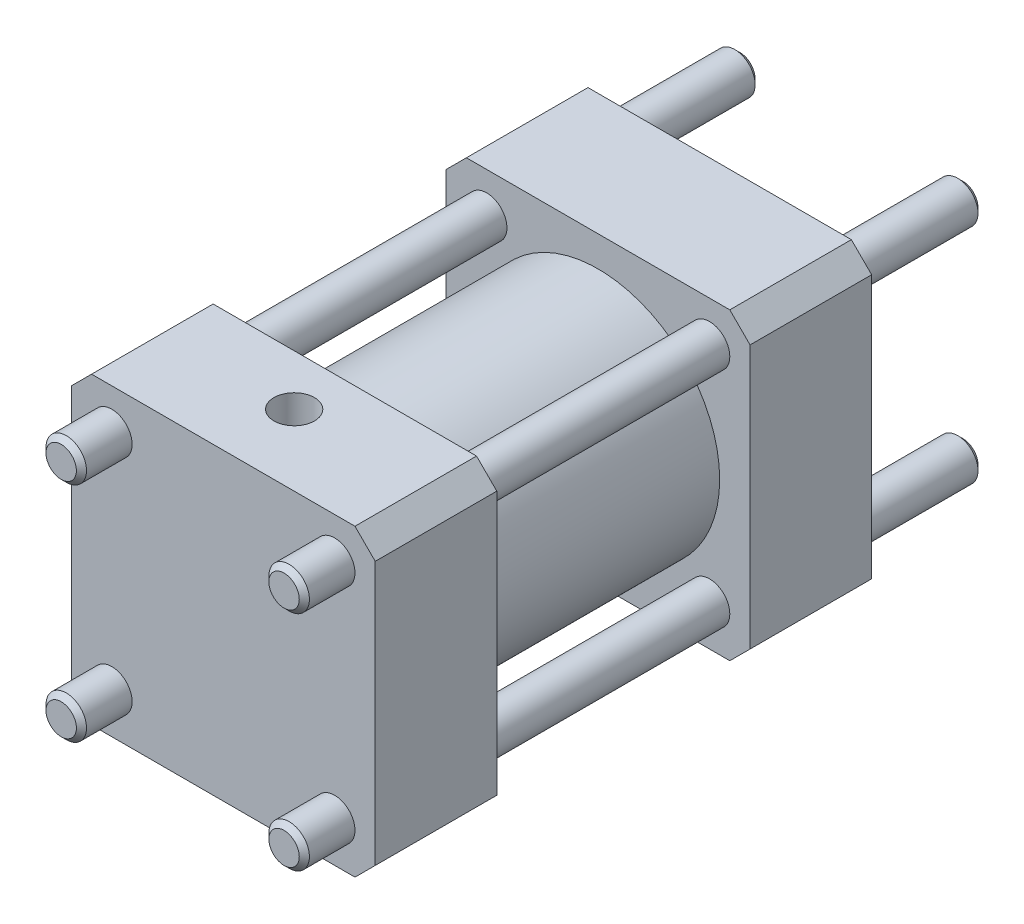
ISO-10303-21;
HEADER;
FILE_DESCRIPTION(('STEP AP214'),'2;1');
FILE_NAME('part.step','',(''),(''),'','','');
FILE_SCHEMA(('AUTOMOTIVE_DESIGN { 1 0 10303 214 1 1 1 1 }'));
ENDSEC;
DATA;
#1=APPLICATION_CONTEXT('core data for automotive mechanical design processes');
#2=APPLICATION_PROTOCOL_DEFINITION('international standard','automotive_design',2000,#1);
#3=PRODUCT_CONTEXT('',#1,'mechanical');
#4=PRODUCT('Part','Part','',(#3));
#5=PRODUCT_RELATED_PRODUCT_CATEGORY('part','',(#4));
#6=PRODUCT_DEFINITION_FORMATION('','',#4);
#7=PRODUCT_DEFINITION_CONTEXT('part definition',#1,'design');
#8=PRODUCT_DEFINITION('design','',#6,#7);
#9=PRODUCT_DEFINITION_SHAPE('','',#8);
#10=(LENGTH_UNIT() NAMED_UNIT(*) SI_UNIT(.MILLI.,.METRE.));
#11=(NAMED_UNIT(*) PLANE_ANGLE_UNIT() SI_UNIT($,.RADIAN.));
#12=(NAMED_UNIT(*) SI_UNIT($,.STERADIAN.) SOLID_ANGLE_UNIT());
#13=UNCERTAINTY_MEASURE_WITH_UNIT(LENGTH_MEASURE(1.E-05),#10,'distance_accuracy_value','');
#14=(GEOMETRIC_REPRESENTATION_CONTEXT(3) GLOBAL_UNCERTAINTY_ASSIGNED_CONTEXT((#13)) GLOBAL_UNIT_ASSIGNED_CONTEXT((#10,
#11,#12)) REPRESENTATION_CONTEXT('',''));
#15=CARTESIAN_POINT('',(0.,0.,0.));
#16=DIRECTION('',(0.,0.,1.));
#17=DIRECTION('',(1.,0.,0.));
#18=AXIS2_PLACEMENT_3D('',#15,#16,#17);
#19=CARTESIAN_POINT('',(15.,15.,20.6704961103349));
#20=DIRECTION('',(0.,0.,-1.));
#21=DIRECTION('',(-1.,0.,0.));
#22=AXIS2_PLACEMENT_3D('',#19,#20,#21);
#23=CYLINDRICAL_SURFACE('',#22,4.);
#24=CARTESIAN_POINT('',(15.,15.,-6.));
#25=DIRECTION('',(0.,0.,-1.));
#26=DIRECTION('',(-1.,0.,0.));
#27=AXIS2_PLACEMENT_3D('',#24,#25,#26);
#28=CIRCLE('',#27,4.);
#29=CARTESIAN_POINT('',(11.,15.,-6.));
#30=VERTEX_POINT('',#29);
#31=EDGE_CURVE('E191',#30,#30,#28,.T.);
#32=ORIENTED_EDGE('',*,*,#31,.T.);
#33=EDGE_LOOP('',(#32));
#34=FACE_BOUND('',#33,.T.);
#35=CARTESIAN_POINT('',(15.,15.,8.));
#36=DIRECTION('',(0.,0.,1.));
#37=DIRECTION('',(1.,0.,0.));
#38=AXIS2_PLACEMENT_3D('',#35,#36,#37);
#39=CIRCLE('',#38,4.);
#40=CARTESIAN_POINT('',(19.,15.,8.));
#41=VERTEX_POINT('',#40);
#42=EDGE_CURVE('E179',#41,#41,#39,.F.);
#43=ORIENTED_EDGE('',*,*,#42,.F.);
#44=EDGE_LOOP('',(#43));
#45=FACE_BOUND('',#44,.T.);
#46=ADVANCED_FACE('F36',(#34,#45),#23,.F.);
#47=CARTESIAN_POINT('',(0.,0.,49.));
#48=DIRECTION('',(0.,0.,-1.));
#49=DIRECTION('',(-1.,0.,0.));
#50=AXIS2_PLACEMENT_3D('',#47,#48,#49);
#51=PLANE('',#50);
#52=CARTESIAN_POINT('',(4.,4.,49.));
#53=DIRECTION('',(0.,0.,-1.));
#54=DIRECTION('',(-1.,0.,0.));
#55=AXIS2_PLACEMENT_3D('',#52,#53,#54);
#56=CIRCLE('',#55,2.00000000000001);
#57=CARTESIAN_POINT('',(1.99999999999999,4.,49.));
#58=VERTEX_POINT('',#57);
#59=EDGE_CURVE('E297',#58,#58,#56,.F.);
#60=ORIENTED_EDGE('',*,*,#59,.F.);
#61=EDGE_LOOP('',(#60));
#62=FACE_BOUND('',#61,.T.);
#63=CARTESIAN_POINT('',(26.,26.,49.));
#64=DIRECTION('',(0.,0.,-1.));
#65=DIRECTION('',(-1.,0.,0.));
#66=AXIS2_PLACEMENT_3D('',#63,#64,#65);
#67=CIRCLE('',#66,2.);
#68=CARTESIAN_POINT('',(24.,26.,49.));
#69=VERTEX_POINT('',#68);
#70=EDGE_CURVE('E291',#69,#69,#67,.F.);
#71=ORIENTED_EDGE('',*,*,#70,.F.);
#72=EDGE_LOOP('',(#71));
#73=FACE_BOUND('',#72,.T.);
#74=DIRECTION('',(-1.,0.,0.));
#75=VECTOR('',#74,1.);
#76=CARTESIAN_POINT('',(30.,0.,49.));
#77=LINE('',#76,#75);
#78=CARTESIAN_POINT('',(28.,0.,49.));
#79=VERTEX_POINT('',#78);
#80=CARTESIAN_POINT('',(1.99999999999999,0.,49.));
#81=VERTEX_POINT('',#80);
#82=EDGE_CURVE('E233',#79,#81,#77,.T.);
#83=ORIENTED_EDGE('',*,*,#82,.F.);
#84=DIRECTION('',(0.707106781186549,0.707106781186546,0.));
#85=VECTOR('',#84,1.);
#86=CARTESIAN_POINT('',(30.,2.00000000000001,49.));
#87=LINE('',#86,#85);
#88=CARTESIAN_POINT('',(30.,2.00000000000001,49.));
#89=VERTEX_POINT('',#88);
#90=EDGE_CURVE('E381',#79,#89,#87,.T.);
#91=ORIENTED_EDGE('',*,*,#90,.T.);
#92=DIRECTION('',(0.,1.,0.));
#93=VECTOR('',#92,1.);
#94=CARTESIAN_POINT('',(30.,0.,49.));
#95=LINE('',#94,#93);
#96=CARTESIAN_POINT('',(30.,28.,49.));
#97=VERTEX_POINT('',#96);
#98=EDGE_CURVE('E236',#89,#97,#95,.T.);
#99=ORIENTED_EDGE('',*,*,#98,.T.);
#100=DIRECTION('',(-0.707106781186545,0.70710678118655,0.));
#101=VECTOR('',#100,1.);
#102=CARTESIAN_POINT('',(28.,30.,49.));
#103=LINE('',#102,#101);
#104=CARTESIAN_POINT('',(28.,30.,49.));
#105=VERTEX_POINT('',#104);
#106=EDGE_CURVE('E375',#97,#105,#103,.T.);
#107=ORIENTED_EDGE('',*,*,#106,.T.);
#108=DIRECTION('',(1.,0.,0.));
#109=VECTOR('',#108,1.);
#110=CARTESIAN_POINT('',(0.,30.,49.));
#111=LINE('',#110,#109);
#112=CARTESIAN_POINT('',(1.99999999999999,30.,49.));
#113=VERTEX_POINT('',#112);
#114=EDGE_CURVE('E239',#113,#105,#111,.T.);
#115=ORIENTED_EDGE('',*,*,#114,.F.);
#116=DIRECTION('',(-0.707106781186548,-0.707106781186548,0.));
#117=VECTOR('',#116,1.);
#118=CARTESIAN_POINT('',(0.,28.,49.));
#119=LINE('',#118,#117);
#120=CARTESIAN_POINT('',(0.,28.,49.));
#121=VERTEX_POINT('',#120);
#122=EDGE_CURVE('E377',#113,#121,#119,.T.);
#123=ORIENTED_EDGE('',*,*,#122,.T.);
#124=DIRECTION('',(0.,-1.,0.));
#125=VECTOR('',#124,1.);
#126=CARTESIAN_POINT('',(0.,30.,49.));
#127=LINE('',#126,#125);
#128=CARTESIAN_POINT('',(0.,1.99999999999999,49.));
#129=VERTEX_POINT('',#128);
#130=EDGE_CURVE('E230',#121,#129,#127,.T.);
#131=ORIENTED_EDGE('',*,*,#130,.T.);
#132=DIRECTION('',(0.707106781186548,-0.707106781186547,0.));
#133=VECTOR('',#132,1.);
#134=CARTESIAN_POINT('',(1.99999999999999,0.,49.));
#135=LINE('',#134,#133);
#136=EDGE_CURVE('E379',#129,#81,#135,.T.);
#137=ORIENTED_EDGE('',*,*,#136,.T.);
#138=EDGE_LOOP('',(#83,#91,#99,#107,#115,#123,#131,#137));
#139=FACE_BOUND('',#138,.T.);
#140=CARTESIAN_POINT('',(26.,4.,49.));
#141=DIRECTION('',(0.,0.,-1.));
#142=DIRECTION('',(-1.,0.,0.));
#143=AXIS2_PLACEMENT_3D('',#140,#141,#142);
#144=CIRCLE('',#143,2.00000000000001);
#145=CARTESIAN_POINT('',(24.,4.,49.));
#146=VERTEX_POINT('',#145);
#147=EDGE_CURVE('E294',#146,#146,#144,.F.);
#148=ORIENTED_EDGE('',*,*,#147,.F.);
#149=EDGE_LOOP('',(#148));
#150=FACE_BOUND('',#149,.T.);
#151=CARTESIAN_POINT('',(4.,26.,49.));
#152=DIRECTION('',(0.,0.,-1.));
#153=DIRECTION('',(-1.,0.,0.));
#154=AXIS2_PLACEMENT_3D('',#151,#152,#153);
#155=CIRCLE('',#154,2.);
#156=CARTESIAN_POINT('',(2.,26.,49.));
#157=VERTEX_POINT('',#156);
#158=EDGE_CURVE('E300',#157,#157,#155,.F.);
#159=ORIENTED_EDGE('',*,*,#158,.F.);
#160=EDGE_LOOP('',(#159));
#161=FACE_BOUND('',#160,.T.);
#162=ADVANCED_FACE('F450',(#62,#73,#139,#150,#161),#51,.F.);
#163=CARTESIAN_POINT('',(0.,30.,0.));
#164=DIRECTION('',(0.,0.,1.));
#165=DIRECTION('',(1.,0.,0.));
#166=AXIS2_PLACEMENT_3D('',#163,#164,#165);
#167=PLANE('',#166);
#168=CARTESIAN_POINT('',(26.,4.,0.));
#169=DIRECTION('',(0.,0.,1.));
#170=DIRECTION('',(1.,0.,0.));
#171=AXIS2_PLACEMENT_3D('',#168,#169,#170);
#172=CIRCLE('',#171,2.00000000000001);
#173=CARTESIAN_POINT('',(28.,4.,0.));
#174=VERTEX_POINT('',#173);
#175=EDGE_CURVE('E285',#174,#174,#172,.F.);
#176=ORIENTED_EDGE('',*,*,#175,.F.);
#177=EDGE_LOOP('',(#176));
#178=FACE_BOUND('',#177,.T.);
#179=CARTESIAN_POINT('',(4.,26.,0.));
#180=DIRECTION('',(0.,0.,1.));
#181=DIRECTION('',(1.,0.,0.));
#182=AXIS2_PLACEMENT_3D('',#179,#180,#181);
#183=CIRCLE('',#182,2.);
#184=CARTESIAN_POINT('',(6.,26.,0.));
#185=VERTEX_POINT('',#184);
#186=EDGE_CURVE('E279',#185,#185,#183,.F.);
#187=ORIENTED_EDGE('',*,*,#186,.F.);
#188=EDGE_LOOP('',(#187));
#189=FACE_BOUND('',#188,.T.);
#190=DIRECTION('',(0.,1.,0.));
#191=VECTOR('',#190,1.);
#192=CARTESIAN_POINT('',(30.,0.,0.));
#193=LINE('',#192,#191);
#194=CARTESIAN_POINT('',(30.,2.,0.));
#195=VERTEX_POINT('',#194);
#196=CARTESIAN_POINT('',(30.,28.,0.));
#197=VERTEX_POINT('',#196);
#198=EDGE_CURVE('E257',#195,#197,#193,.T.);
#199=ORIENTED_EDGE('',*,*,#198,.F.);
#200=DIRECTION('',(-0.707106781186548,-0.707106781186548,0.));
#201=VECTOR('',#200,1.);
#202=CARTESIAN_POINT('',(30.,2.,0.));
#203=LINE('',#202,#201);
#204=CARTESIAN_POINT('',(28.,0.,0.));
#205=VERTEX_POINT('',#204);
#206=EDGE_CURVE('E394',#195,#205,#203,.T.);
#207=ORIENTED_EDGE('',*,*,#206,.T.);
#208=DIRECTION('',(-1.,0.,0.));
#209=VECTOR('',#208,1.);
#210=CARTESIAN_POINT('',(30.,0.,0.));
#211=LINE('',#210,#209);
#212=CARTESIAN_POINT('',(2.,0.,0.));
#213=VERTEX_POINT('',#212);
#214=EDGE_CURVE('E254',#205,#213,#211,.T.);
#215=ORIENTED_EDGE('',*,*,#214,.T.);
#216=DIRECTION('',(-0.707106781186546,0.707106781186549,0.));
#217=VECTOR('',#216,1.);
#218=CARTESIAN_POINT('',(2.,0.,0.));
#219=LINE('',#218,#217);
#220=CARTESIAN_POINT('',(0.,2.00000000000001,0.));
#221=VERTEX_POINT('',#220);
#222=EDGE_CURVE('E392',#213,#221,#219,.T.);
#223=ORIENTED_EDGE('',*,*,#222,.T.);
#224=DIRECTION('',(0.,-1.,0.));
#225=VECTOR('',#224,1.);
#226=CARTESIAN_POINT('',(0.,30.,0.));
#227=LINE('',#226,#225);
#228=CARTESIAN_POINT('',(0.,28.,0.));
#229=VERTEX_POINT('',#228);
#230=EDGE_CURVE('E251',#229,#221,#227,.T.);
#231=ORIENTED_EDGE('',*,*,#230,.F.);
#232=DIRECTION('',(0.707106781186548,0.707106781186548,0.));
#233=VECTOR('',#232,1.);
#234=CARTESIAN_POINT('',(0.,28.,0.));
#235=LINE('',#234,#233);
#236=CARTESIAN_POINT('',(1.99999999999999,30.,0.));
#237=VERTEX_POINT('',#236);
#238=EDGE_CURVE('E388',#229,#237,#235,.T.);
#239=ORIENTED_EDGE('',*,*,#238,.T.);
#240=DIRECTION('',(1.,0.,0.));
#241=VECTOR('',#240,1.);
#242=CARTESIAN_POINT('',(0.,30.,0.));
#243=LINE('',#242,#241);
#244=CARTESIAN_POINT('',(28.,30.,0.));
#245=VERTEX_POINT('',#244);
#246=EDGE_CURVE('E260',#237,#245,#243,.T.);
#247=ORIENTED_EDGE('',*,*,#246,.T.);
#248=DIRECTION('',(0.707106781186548,-0.707106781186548,0.));
#249=VECTOR('',#248,1.);
#250=CARTESIAN_POINT('',(28.,30.,0.));
#251=LINE('',#250,#249);
#252=EDGE_CURVE('E390',#245,#197,#251,.T.);
#253=ORIENTED_EDGE('',*,*,#252,.T.);
#254=EDGE_LOOP('',(#199,#207,#215,#223,#231,#239,#247,#253));
#255=FACE_BOUND('',#254,.T.);
#256=CARTESIAN_POINT('',(15.,15.,0.));
#257=DIRECTION('',(0.,0.,1.));
#258=DIRECTION('',(1.,0.,0.));
#259=AXIS2_PLACEMENT_3D('',#256,#257,#258);
#260=CIRCLE('',#259,9.);
#261=CARTESIAN_POINT('',(24.,15.,0.));
#262=VERTEX_POINT('',#261);
#263=EDGE_CURVE('E276',#262,#262,#260,.F.);
#264=ORIENTED_EDGE('',*,*,#263,.F.);
#265=EDGE_LOOP('',(#264));
#266=FACE_BOUND('',#265,.T.);
#267=CARTESIAN_POINT('',(4.,4.,0.));
#268=DIRECTION('',(0.,0.,1.));
#269=DIRECTION('',(1.,0.,0.));
#270=AXIS2_PLACEMENT_3D('',#267,#268,#269);
#271=CIRCLE('',#270,2.00000000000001);
#272=CARTESIAN_POINT('',(6.,4.,0.));
#273=VERTEX_POINT('',#272);
#274=EDGE_CURVE('E282',#273,#273,#271,.F.);
#275=ORIENTED_EDGE('',*,*,#274,.F.);
#276=EDGE_LOOP('',(#275));
#277=FACE_BOUND('',#276,.T.);
#278=CARTESIAN_POINT('',(26.,26.,0.));
#279=DIRECTION('',(0.,0.,1.));
#280=DIRECTION('',(1.,0.,0.));
#281=AXIS2_PLACEMENT_3D('',#278,#279,#280);
#282=CIRCLE('',#281,2.);
#283=CARTESIAN_POINT('',(28.,26.,0.));
#284=VERTEX_POINT('',#283);
#285=EDGE_CURVE('E288',#284,#284,#282,.F.);
#286=ORIENTED_EDGE('',*,*,#285,.F.);
#287=EDGE_LOOP('',(#286));
#288=FACE_BOUND('',#287,.T.);
#289=ADVANCED_FACE('F456',(#178,#189,#255,#266,#277,#288),#167,.F.);
#290=CARTESIAN_POINT('',(0.,30.,12.));
#291=DIRECTION('',(0.,0.,1.));
#292=DIRECTION('',(1.,0.,0.));
#293=AXIS2_PLACEMENT_3D('',#290,#291,#292);
#294=PLANE('',#293);
#295=CARTESIAN_POINT('',(26.,4.,11.9999999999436));
#296=DIRECTION('',(0.,0.,1.));
#297=DIRECTION('',(1.,0.,0.));
#298=AXIS2_PLACEMENT_3D('',#295,#296,#297);
#299=CIRCLE('',#298,2.);
#300=CARTESIAN_POINT('',(28.,4.,11.9999999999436));
#301=VERTEX_POINT('',#300);
#302=EDGE_CURVE('E203',#301,#301,#299,.T.);
#303=ORIENTED_EDGE('',*,*,#302,.F.);
#304=EDGE_LOOP('',(#303));
#305=FACE_BOUND('',#304,.T.);
#306=CARTESIAN_POINT('',(4.,26.,12.));
#307=DIRECTION('',(0.,0.,1.));
#308=DIRECTION('',(1.,0.,0.));
#309=AXIS2_PLACEMENT_3D('',#306,#307,#308);
#310=CIRCLE('',#309,2.);
#311=CARTESIAN_POINT('',(6.,26.,12.));
#312=VERTEX_POINT('',#311);
#313=EDGE_CURVE('E215',#312,#312,#310,.T.);
#314=ORIENTED_EDGE('',*,*,#313,.F.);
#315=EDGE_LOOP('',(#314));
#316=FACE_BOUND('',#315,.T.);
#317=DIRECTION('',(-1.,0.,0.));
#318=VECTOR('',#317,1.);
#319=CARTESIAN_POINT('',(30.,0.,12.));
#320=LINE('',#319,#318);
#321=CARTESIAN_POINT('',(28.,0.,12.));
#322=VERTEX_POINT('',#321);
#323=CARTESIAN_POINT('',(2.,0.,12.));
#324=VERTEX_POINT('',#323);
#325=EDGE_CURVE('E266',#322,#324,#320,.T.);
#326=ORIENTED_EDGE('',*,*,#325,.F.);
#327=DIRECTION('',(0.707106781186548,0.707106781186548,0.));
#328=VECTOR('',#327,1.);
#329=CARTESIAN_POINT('',(29.,0.999999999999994,12.));
#330=LINE('',#329,#328);
#331=CARTESIAN_POINT('',(30.,2.,12.));
#332=VERTEX_POINT('',#331);
#333=EDGE_CURVE('E406',#322,#332,#330,.T.);
#334=ORIENTED_EDGE('',*,*,#333,.T.);
#335=DIRECTION('',(0.,1.,0.));
#336=VECTOR('',#335,1.);
#337=CARTESIAN_POINT('',(30.,0.,12.));
#338=LINE('',#337,#336);
#339=CARTESIAN_POINT('',(30.,28.,12.));
#340=VERTEX_POINT('',#339);
#341=EDGE_CURVE('E269',#332,#340,#338,.T.);
#342=ORIENTED_EDGE('',*,*,#341,.T.);
#343=DIRECTION('',(-0.707106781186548,0.707106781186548,0.));
#344=VECTOR('',#343,1.);
#345=CARTESIAN_POINT('',(14.,44.,12.));
#346=LINE('',#345,#344);
#347=CARTESIAN_POINT('',(28.,30.,12.));
#348=VERTEX_POINT('',#347);
#349=EDGE_CURVE('E59',#340,#348,#346,.T.);
#350=ORIENTED_EDGE('',*,*,#349,.T.);
#351=DIRECTION('',(1.,0.,0.));
#352=VECTOR('',#351,1.);
#353=CARTESIAN_POINT('',(0.,30.,12.));
#354=LINE('',#353,#352);
#355=CARTESIAN_POINT('',(1.99999999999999,30.,12.));
#356=VERTEX_POINT('',#355);
#357=EDGE_CURVE('E271',#356,#348,#354,.T.);
#358=ORIENTED_EDGE('',*,*,#357,.F.);
#359=DIRECTION('',(-0.707106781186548,-0.707106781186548,0.));
#360=VECTOR('',#359,1.);
#361=CARTESIAN_POINT('',(0.999999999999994,29.,12.));
#362=LINE('',#361,#360);
#363=CARTESIAN_POINT('',(0.,28.,12.));
#364=VERTEX_POINT('',#363);
#365=EDGE_CURVE('E401',#356,#364,#362,.T.);
#366=ORIENTED_EDGE('',*,*,#365,.T.);
#367=DIRECTION('',(0.,-1.,0.));
#368=VECTOR('',#367,1.);
#369=CARTESIAN_POINT('',(0.,30.,12.));
#370=LINE('',#369,#368);
#371=CARTESIAN_POINT('',(0.,2.,12.));
#372=VERTEX_POINT('',#371);
#373=EDGE_CURVE('E263',#364,#372,#370,.T.);
#374=ORIENTED_EDGE('',*,*,#373,.T.);
#375=DIRECTION('',(0.707106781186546,-0.707106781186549,0.));
#376=VECTOR('',#375,1.);
#377=CARTESIAN_POINT('',(-14.,16.,12.));
#378=LINE('',#377,#376);
#379=EDGE_CURVE('E404',#372,#324,#378,.T.);
#380=ORIENTED_EDGE('',*,*,#379,.T.);
#381=EDGE_LOOP('',(#326,#334,#342,#350,#358,#366,#374,#380));
#382=FACE_BOUND('',#381,.T.);
#383=CARTESIAN_POINT('',(15.,15.,12.));
#384=DIRECTION('',(0.,0.,1.));
#385=DIRECTION('',(1.,0.,0.));
#386=AXIS2_PLACEMENT_3D('',#383,#384,#385);
#387=CIRCLE('',#386,12.);
#388=CARTESIAN_POINT('',(27.,15.,12.));
#389=VERTEX_POINT('',#388);
#390=EDGE_CURVE('E245',#389,#389,#387,.T.);
#391=ORIENTED_EDGE('',*,*,#390,.F.);
#392=EDGE_LOOP('',(#391));
#393=FACE_BOUND('',#392,.T.);
#394=CARTESIAN_POINT('',(26.,26.,11.9999999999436));
#395=DIRECTION('',(0.,0.,1.));
#396=DIRECTION('',(1.,0.,0.));
#397=AXIS2_PLACEMENT_3D('',#394,#395,#396);
#398=CIRCLE('',#397,2.);
#399=CARTESIAN_POINT('',(28.,26.,11.9999999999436));
#400=VERTEX_POINT('',#399);
#401=EDGE_CURVE('E209',#400,#400,#398,.T.);
#402=ORIENTED_EDGE('',*,*,#401,.F.);
#403=EDGE_LOOP('',(#402));
#404=FACE_BOUND('',#403,.T.);
#405=CARTESIAN_POINT('',(4.,4.,11.9999999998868));
#406=DIRECTION('',(0.,0.,1.));
#407=DIRECTION('',(1.,0.,0.));
#408=AXIS2_PLACEMENT_3D('',#405,#406,#407);
#409=CIRCLE('',#408,2.);
#410=CARTESIAN_POINT('',(6.,4.,11.9999999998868));
#411=VERTEX_POINT('',#410);
#412=EDGE_CURVE('E197',#411,#411,#409,.T.);
#413=ORIENTED_EDGE('',*,*,#412,.F.);
#414=EDGE_LOOP('',(#413));
#415=FACE_BOUND('',#414,.T.);
#416=ADVANCED_FACE('F621',(#305,#316,#382,#393,#404,#415),#294,.T.);
#417=CARTESIAN_POINT('',(0.,0.,37.));
#418=DIRECTION('',(0.,0.,-1.));
#419=DIRECTION('',(-1.,0.,0.));
#420=AXIS2_PLACEMENT_3D('',#417,#418,#419);
#421=PLANE('',#420);
#422=CARTESIAN_POINT('',(26.,4.,37.));
#423=DIRECTION('',(0.,0.,-1.));
#424=DIRECTION('',(-1.,0.,0.));
#425=AXIS2_PLACEMENT_3D('',#422,#423,#424);
#426=CIRCLE('',#425,2.);
#427=CARTESIAN_POINT('',(24.,4.,37.));
#428=VERTEX_POINT('',#427);
#429=EDGE_CURVE('E200',#428,#428,#426,.T.);
#430=ORIENTED_EDGE('',*,*,#429,.F.);
#431=EDGE_LOOP('',(#430));
#432=FACE_BOUND('',#431,.T.);
#433=CARTESIAN_POINT('',(4.,26.,37.));
#434=DIRECTION('',(0.,0.,-1.));
#435=DIRECTION('',(-1.,0.,0.));
#436=AXIS2_PLACEMENT_3D('',#433,#434,#435);
#437=CIRCLE('',#436,2.);
#438=CARTESIAN_POINT('',(2.,26.,37.));
#439=VERTEX_POINT('',#438);
#440=EDGE_CURVE('E212',#439,#439,#437,.T.);
#441=ORIENTED_EDGE('',*,*,#440,.F.);
#442=EDGE_LOOP('',(#441));
#443=FACE_BOUND('',#442,.T.);
#444=DIRECTION('',(0.,1.,0.));
#445=VECTOR('',#444,1.);
#446=CARTESIAN_POINT('',(30.,0.,37.));
#447=LINE('',#446,#445);
#448=CARTESIAN_POINT('',(30.,2.00000000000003,37.));
#449=VERTEX_POINT('',#448);
#450=CARTESIAN_POINT('',(30.,28.,37.));
#451=VERTEX_POINT('',#450);
#452=EDGE_CURVE('E224',#449,#451,#447,.T.);
#453=ORIENTED_EDGE('',*,*,#452,.F.);
#454=DIRECTION('',(-0.707106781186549,-0.707106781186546,0.));
#455=VECTOR('',#454,1.);
#456=CARTESIAN_POINT('',(13.9999999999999,-14.,37.));
#457=LINE('',#456,#455);
#458=CARTESIAN_POINT('',(28.,0.,37.));
#459=VERTEX_POINT('',#458);
#460=EDGE_CURVE('E368',#449,#459,#457,.T.);
#461=ORIENTED_EDGE('',*,*,#460,.T.);
#462=DIRECTION('',(-1.,0.,0.));
#463=VECTOR('',#462,1.);
#464=CARTESIAN_POINT('',(30.,0.,37.));
#465=LINE('',#464,#463);
#466=CARTESIAN_POINT('',(1.99999999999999,0.,37.));
#467=VERTEX_POINT('',#466);
#468=EDGE_CURVE('E221',#459,#467,#465,.T.);
#469=ORIENTED_EDGE('',*,*,#468,.T.);
#470=DIRECTION('',(-0.707106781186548,0.707106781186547,0.));
#471=VECTOR('',#470,1.);
#472=CARTESIAN_POINT('',(0.999999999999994,0.999999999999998,37.));
#473=LINE('',#472,#471);
#474=CARTESIAN_POINT('',(0.,1.99999999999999,37.));
#475=VERTEX_POINT('',#474);
#476=EDGE_CURVE('E366',#467,#475,#473,.T.);
#477=ORIENTED_EDGE('',*,*,#476,.T.);
#478=DIRECTION('',(0.,-1.,0.));
#479=VECTOR('',#478,1.);
#480=CARTESIAN_POINT('',(0.,30.,37.));
#481=LINE('',#480,#479);
#482=CARTESIAN_POINT('',(0.,28.,37.));
#483=VERTEX_POINT('',#482);
#484=EDGE_CURVE('E218',#483,#475,#481,.T.);
#485=ORIENTED_EDGE('',*,*,#484,.F.);
#486=DIRECTION('',(0.707106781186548,0.707106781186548,0.));
#487=VECTOR('',#486,1.);
#488=CARTESIAN_POINT('',(-14.,14.,37.));
#489=LINE('',#488,#487);
#490=CARTESIAN_POINT('',(1.99999999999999,30.,37.));
#491=VERTEX_POINT('',#490);
#492=EDGE_CURVE('E364',#483,#491,#489,.T.);
#493=ORIENTED_EDGE('',*,*,#492,.T.);
#494=DIRECTION('',(1.,0.,0.));
#495=VECTOR('',#494,1.);
#496=CARTESIAN_POINT('',(0.,30.,37.));
#497=LINE('',#496,#495);
#498=CARTESIAN_POINT('',(28.,30.,37.));
#499=VERTEX_POINT('',#498);
#500=EDGE_CURVE('E227',#491,#499,#497,.T.);
#501=ORIENTED_EDGE('',*,*,#500,.T.);
#502=DIRECTION('',(0.707106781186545,-0.70710678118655,0.));
#503=VECTOR('',#502,1.);
#504=CARTESIAN_POINT('',(29.0000000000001,28.9999999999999,37.));
#505=LINE('',#504,#503);
#506=EDGE_CURVE('E362',#499,#451,#505,.T.);
#507=ORIENTED_EDGE('',*,*,#506,.T.);
#508=EDGE_LOOP('',(#453,#461,#469,#477,#485,#493,#501,#507));
#509=FACE_BOUND('',#508,.T.);
#510=CARTESIAN_POINT('',(15.,15.,37.));
#511=DIRECTION('',(0.,0.,1.));
#512=DIRECTION('',(1.,0.,0.));
#513=AXIS2_PLACEMENT_3D('',#510,#511,#512);
#514=CIRCLE('',#513,12.);
#515=CARTESIAN_POINT('',(27.,15.,37.));
#516=VERTEX_POINT('',#515);
#517=EDGE_CURVE('E248',#516,#516,#514,.T.);
#518=ORIENTED_EDGE('',*,*,#517,.T.);
#519=EDGE_LOOP('',(#518));
#520=FACE_BOUND('',#519,.T.);
#521=CARTESIAN_POINT('',(26.,26.,37.));
#522=DIRECTION('',(0.,0.,-1.));
#523=DIRECTION('',(-1.,0.,0.));
#524=AXIS2_PLACEMENT_3D('',#521,#522,#523);
#525=CIRCLE('',#524,2.);
#526=CARTESIAN_POINT('',(24.,26.,37.));
#527=VERTEX_POINT('',#526);
#528=EDGE_CURVE('E206',#527,#527,#525,.T.);
#529=ORIENTED_EDGE('',*,*,#528,.F.);
#530=EDGE_LOOP('',(#529));
#531=FACE_BOUND('',#530,.T.);
#532=CARTESIAN_POINT('',(4.,4.,37.));
#533=DIRECTION('',(0.,0.,-1.));
#534=DIRECTION('',(-1.,0.,0.));
#535=AXIS2_PLACEMENT_3D('',#532,#533,#534);
#536=CIRCLE('',#535,2.);
#537=CARTESIAN_POINT('',(1.99999999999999,4.,37.));
#538=VERTEX_POINT('',#537);
#539=EDGE_CURVE('E194',#538,#538,#536,.T.);
#540=ORIENTED_EDGE('',*,*,#539,.F.);
#541=EDGE_LOOP('',(#540));
#542=FACE_BOUND('',#541,.T.);
#543=ADVANCED_FACE('F593',(#432,#443,#509,#520,#531,#542),#421,.T.);
#544=CARTESIAN_POINT('',(0.,30.,12.));
#545=DIRECTION('',(1.,0.,0.));
#546=DIRECTION('',(0.,1.,0.));
#547=AXIS2_PLACEMENT_3D('',#544,#545,#546);
#548=PLANE('',#547);
#549=ORIENTED_EDGE('',*,*,#230,.T.);
#550=DIRECTION('',(0.,0.,1.));
#551=VECTOR('',#550,1.);
#552=CARTESIAN_POINT('',(0.,2.00000000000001,12.));
#553=LINE('',#552,#551);
#554=EDGE_CURVE('E411',#221,#372,#553,.T.);
#555=ORIENTED_EDGE('',*,*,#554,.T.);
#556=ORIENTED_EDGE('',*,*,#373,.F.);
#557=DIRECTION('',(0.,0.,-1.));
#558=VECTOR('',#557,1.);
#559=CARTESIAN_POINT('',(0.,28.,0.));
#560=LINE('',#559,#558);
#561=EDGE_CURVE('E408',#364,#229,#560,.T.);
#562=ORIENTED_EDGE('',*,*,#561,.T.);
#563=EDGE_LOOP('',(#549,#555,#556,#562));
#564=FACE_BOUND('',#563,.T.);
#565=ADVANCED_FACE('F38',(#564),#548,.F.);
#566=CARTESIAN_POINT('',(30.,0.,12.));
#567=DIRECTION('',(0.,-1.,0.));
#568=DIRECTION('',(0.,0.,-1.));
#569=AXIS2_PLACEMENT_3D('',#566,#567,#568);
#570=PLANE('',#569);
#571=ORIENTED_EDGE('',*,*,#214,.F.);
#572=DIRECTION('',(0.,0.,1.));
#573=VECTOR('',#572,1.);
#574=CARTESIAN_POINT('',(28.,0.,12.));
#575=LINE('',#574,#573);
#576=EDGE_CURVE('E399',#205,#322,#575,.T.);
#577=ORIENTED_EDGE('',*,*,#576,.T.);
#578=ORIENTED_EDGE('',*,*,#325,.T.);
#579=DIRECTION('',(0.,0.,-1.));
#580=VECTOR('',#579,1.);
#581=CARTESIAN_POINT('',(2.,0.,0.));
#582=LINE('',#581,#580);
#583=EDGE_CURVE('E396',#324,#213,#582,.T.);
#584=ORIENTED_EDGE('',*,*,#583,.T.);
#585=EDGE_LOOP('',(#571,#577,#578,#584));
#586=FACE_BOUND('',#585,.T.);
#587=ADVANCED_FACE('F632',(#586),#570,.T.);
#588=CARTESIAN_POINT('',(30.,0.,12.));
#589=DIRECTION('',(-1.,0.,0.));
#590=DIRECTION('',(0.,-1.,0.));
#591=AXIS2_PLACEMENT_3D('',#588,#589,#590);
#592=PLANE('',#591);
#593=ORIENTED_EDGE('',*,*,#341,.F.);
#594=DIRECTION('',(0.,0.,-1.));
#595=VECTOR('',#594,1.);
#596=CARTESIAN_POINT('',(30.,2.,0.));
#597=LINE('',#596,#595);
#598=EDGE_CURVE('E385',#332,#195,#597,.T.);
#599=ORIENTED_EDGE('',*,*,#598,.T.);
#600=ORIENTED_EDGE('',*,*,#198,.T.);
#601=DIRECTION('',(0.,0.,1.));
#602=VECTOR('',#601,1.);
#603=CARTESIAN_POINT('',(30.,28.,12.));
#604=LINE('',#603,#602);
#605=EDGE_CURVE('E383',#197,#340,#604,.T.);
#606=ORIENTED_EDGE('',*,*,#605,.T.);
#607=EDGE_LOOP('',(#593,#599,#600,#606));
#608=FACE_BOUND('',#607,.T.);
#609=ADVANCED_FACE('F629',(#608),#592,.F.);
#610=CARTESIAN_POINT('',(0.,30.,12.));
#611=DIRECTION('',(0.,1.,0.));
#612=DIRECTION('',(-1.,0.,0.));
#613=AXIS2_PLACEMENT_3D('',#610,#611,#612);
#614=PLANE('',#613);
#615=ORIENTED_EDGE('',*,*,#357,.T.);
#616=DIRECTION('',(0.,0.,-1.));
#617=VECTOR('',#616,1.);
#618=CARTESIAN_POINT('',(28.,30.,0.));
#619=LINE('',#618,#617);
#620=EDGE_CURVE('E425',#348,#245,#619,.T.);
#621=ORIENTED_EDGE('',*,*,#620,.T.);
#622=ORIENTED_EDGE('',*,*,#246,.F.);
#623=DIRECTION('',(0.,0.,1.));
#624=VECTOR('',#623,1.);
#625=CARTESIAN_POINT('',(1.99999999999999,30.,12.));
#626=LINE('',#625,#624);
#627=EDGE_CURVE('E423',#237,#356,#626,.T.);
#628=ORIENTED_EDGE('',*,*,#627,.T.);
#629=EDGE_LOOP('',(#615,#621,#622,#628));
#630=FACE_BOUND('',#629,.T.);
#631=ADVANCED_FACE('F617',(#630),#614,.T.);
#632=CARTESIAN_POINT('',(15.,15.,37.));
#633=DIRECTION('',(0.,0.,-1.));
#634=DIRECTION('',(-1.,0.,0.));
#635=AXIS2_PLACEMENT_3D('',#632,#633,#634);
#636=CYLINDRICAL_SURFACE('',#635,12.);
#637=ORIENTED_EDGE('',*,*,#517,.F.);
#638=EDGE_LOOP('',(#637));
#639=FACE_BOUND('',#638,.T.);
#640=ORIENTED_EDGE('',*,*,#390,.T.);
#641=EDGE_LOOP('',(#640));
#642=FACE_BOUND('',#641,.T.);
#643=ADVANCED_FACE('F609',(#639,#642),#636,.T.);
#644=CARTESIAN_POINT('',(0.,30.,49.));
#645=DIRECTION('',(1.,0.,0.));
#646=DIRECTION('',(0.,1.,0.));
#647=AXIS2_PLACEMENT_3D('',#644,#645,#646);
#648=PLANE('',#647);
#649=ORIENTED_EDGE('',*,*,#484,.T.);
#650=DIRECTION('',(0.,0.,1.));
#651=VECTOR('',#650,1.);
#652=CARTESIAN_POINT('',(0.,1.99999999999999,49.));
#653=LINE('',#652,#651);
#654=EDGE_CURVE('E416',#475,#129,#653,.T.);
#655=ORIENTED_EDGE('',*,*,#654,.T.);
#656=ORIENTED_EDGE('',*,*,#130,.F.);
#657=DIRECTION('',(0.,0.,-1.));
#658=VECTOR('',#657,1.);
#659=CARTESIAN_POINT('',(0.,28.,37.));
#660=LINE('',#659,#658);
#661=EDGE_CURVE('E413',#121,#483,#660,.T.);
#662=ORIENTED_EDGE('',*,*,#661,.T.);
#663=EDGE_LOOP('',(#649,#655,#656,#662));
#664=FACE_BOUND('',#663,.T.);
#665=ADVANCED_FACE('F605',(#664),#648,.F.);
#666=CARTESIAN_POINT('',(30.,0.,49.));
#667=DIRECTION('',(0.,-1.,0.));
#668=DIRECTION('',(1.,0.,0.));
#669=AXIS2_PLACEMENT_3D('',#666,#667,#668);
#670=PLANE('',#669);
#671=ORIENTED_EDGE('',*,*,#468,.F.);
#672=DIRECTION('',(0.,0.,1.));
#673=VECTOR('',#672,1.);
#674=CARTESIAN_POINT('',(28.,0.,49.));
#675=LINE('',#674,#673);
#676=EDGE_CURVE('E373',#459,#79,#675,.T.);
#677=ORIENTED_EDGE('',*,*,#676,.T.);
#678=ORIENTED_EDGE('',*,*,#82,.T.);
#679=DIRECTION('',(0.,0.,-1.));
#680=VECTOR('',#679,1.);
#681=CARTESIAN_POINT('',(1.99999999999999,0.,37.));
#682=LINE('',#681,#680);
#683=EDGE_CURVE('E370',#81,#467,#682,.T.);
#684=ORIENTED_EDGE('',*,*,#683,.T.);
#685=EDGE_LOOP('',(#671,#677,#678,#684));
#686=FACE_BOUND('',#685,.T.);
#687=ADVANCED_FACE('F601',(#686),#670,.T.);
#688=CARTESIAN_POINT('',(30.,0.,49.));
#689=DIRECTION('',(-1.,0.,0.));
#690=DIRECTION('',(0.,0.,1.));
#691=AXIS2_PLACEMENT_3D('',#688,#689,#690);
#692=PLANE('',#691);
#693=ORIENTED_EDGE('',*,*,#98,.F.);
#694=DIRECTION('',(0.,0.,-1.));
#695=VECTOR('',#694,1.);
#696=CARTESIAN_POINT('',(30.,2.00000000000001,37.));
#697=LINE('',#696,#695);
#698=EDGE_CURVE('E359',#89,#449,#697,.T.);
#699=ORIENTED_EDGE('',*,*,#698,.T.);
#700=ORIENTED_EDGE('',*,*,#452,.T.);
#701=DIRECTION('',(0.,0.,1.));
#702=VECTOR('',#701,1.);
#703=CARTESIAN_POINT('',(30.,28.,49.));
#704=LINE('',#703,#702);
#705=EDGE_CURVE('E357',#451,#97,#704,.T.);
#706=ORIENTED_EDGE('',*,*,#705,.T.);
#707=EDGE_LOOP('',(#693,#699,#700,#706));
#708=FACE_BOUND('',#707,.T.);
#709=ADVANCED_FACE('F597',(#708),#692,.F.);
#710=CARTESIAN_POINT('',(0.,30.,49.));
#711=DIRECTION('',(0.,1.,0.));
#712=DIRECTION('',(0.,0.,1.));
#713=AXIS2_PLACEMENT_3D('',#710,#711,#712);
#714=PLANE('',#713);
#715=CARTESIAN_POINT('',(15.,30.,42.));
#716=DIRECTION('',(0.,1.,0.));
#717=DIRECTION('',(0.,0.,1.));
#718=AXIS2_PLACEMENT_3D('',#715,#716,#717);
#719=CIRCLE('',#718,2.);
#720=CARTESIAN_POINT('',(15.,30.,44.));
#721=VERTEX_POINT('',#720);
#722=EDGE_CURVE('E176',#721,#721,#719,.T.);
#723=ORIENTED_EDGE('',*,*,#722,.F.);
#724=EDGE_LOOP('',(#723));
#725=FACE_BOUND('',#724,.T.);
#726=ORIENTED_EDGE('',*,*,#500,.F.);
#727=DIRECTION('',(0.,0.,1.));
#728=VECTOR('',#727,1.);
#729=CARTESIAN_POINT('',(1.99999999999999,30.,49.));
#730=LINE('',#729,#728);
#731=EDGE_CURVE('E421',#491,#113,#730,.T.);
#732=ORIENTED_EDGE('',*,*,#731,.T.);
#733=ORIENTED_EDGE('',*,*,#114,.T.);
#734=DIRECTION('',(0.,0.,-1.));
#735=VECTOR('',#734,1.);
#736=CARTESIAN_POINT('',(28.,30.,37.));
#737=LINE('',#736,#735);
#738=EDGE_CURVE('E418',#105,#499,#737,.T.);
#739=ORIENTED_EDGE('',*,*,#738,.T.);
#740=EDGE_LOOP('',(#726,#732,#733,#739));
#741=FACE_BOUND('',#740,.T.);
#742=ADVANCED_FACE('F587',(#725,#741),#714,.T.);
#743=CARTESIAN_POINT('',(4.,26.,49.001));
#744=DIRECTION('',(0.,0.,-1.));
#745=DIRECTION('',(-1.,0.,0.));
#746=AXIS2_PLACEMENT_3D('',#743,#744,#745);
#747=CYLINDRICAL_SURFACE('',#746,2.);
#748=ORIENTED_EDGE('',*,*,#440,.T.);
#749=EDGE_LOOP('',(#748));
#750=FACE_BOUND('',#749,.T.);
#751=ORIENTED_EDGE('',*,*,#313,.T.);
#752=EDGE_LOOP('',(#751));
#753=FACE_BOUND('',#752,.T.);
#754=ADVANCED_FACE('F583',(#750,#753),#747,.T.);
#755=CARTESIAN_POINT('',(26.,26.,49.001));
#756=DIRECTION('',(0.,0.,-1.));
#757=DIRECTION('',(-1.,0.,0.));
#758=AXIS2_PLACEMENT_3D('',#755,#756,#757);
#759=CYLINDRICAL_SURFACE('',#758,2.);
#760=ORIENTED_EDGE('',*,*,#528,.T.);
#761=EDGE_LOOP('',(#760));
#762=FACE_BOUND('',#761,.T.);
#763=ORIENTED_EDGE('',*,*,#401,.T.);
#764=EDGE_LOOP('',(#763));
#765=FACE_BOUND('',#764,.T.);
#766=ADVANCED_FACE('F579',(#762,#765),#759,.T.);
#767=CARTESIAN_POINT('',(26.,4.,49.001));
#768=DIRECTION('',(0.,0.,-1.));
#769=DIRECTION('',(-1.,0.,0.));
#770=AXIS2_PLACEMENT_3D('',#767,#768,#769);
#771=CYLINDRICAL_SURFACE('',#770,2.);
#772=ORIENTED_EDGE('',*,*,#429,.T.);
#773=EDGE_LOOP('',(#772));
#774=FACE_BOUND('',#773,.T.);
#775=ORIENTED_EDGE('',*,*,#302,.T.);
#776=EDGE_LOOP('',(#775));
#777=FACE_BOUND('',#776,.T.);
#778=ADVANCED_FACE('F575',(#774,#777),#771,.T.);
#779=CARTESIAN_POINT('',(4.,4.,49.001));
#780=DIRECTION('',(0.,0.,-1.));
#781=DIRECTION('',(-1.,0.,0.));
#782=AXIS2_PLACEMENT_3D('',#779,#780,#781);
#783=CYLINDRICAL_SURFACE('',#782,2.);
#784=ORIENTED_EDGE('',*,*,#539,.T.);
#785=EDGE_LOOP('',(#784));
#786=FACE_BOUND('',#785,.T.);
#787=ORIENTED_EDGE('',*,*,#412,.T.);
#788=EDGE_LOOP('',(#787));
#789=FACE_BOUND('',#788,.T.);
#790=ADVANCED_FACE('F571',(#786,#789),#783,.T.);
#791=CARTESIAN_POINT('',(15.,15.,-6.));
#792=DIRECTION('',(0.,0.,1.));
#793=DIRECTION('',(1.,0.,0.));
#794=AXIS2_PLACEMENT_3D('',#791,#792,#793);
#795=CYLINDRICAL_SURFACE('',#794,9.);
#796=CARTESIAN_POINT('',(15.,15.,-4.99999999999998));
#797=DIRECTION('',(0.,0.,-1.));
#798=DIRECTION('',(-1.,0.,0.));
#799=AXIS2_PLACEMENT_3D('',#796,#797,#798);
#800=CIRCLE('',#799,9.);
#801=CARTESIAN_POINT('',(6.,15.,-4.99999999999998));
#802=VERTEX_POINT('',#801);
#803=EDGE_CURVE('E354',#802,#802,#800,.F.);
#804=ORIENTED_EDGE('',*,*,#803,.T.);
#805=EDGE_LOOP('',(#804));
#806=FACE_BOUND('',#805,.T.);
#807=ORIENTED_EDGE('',*,*,#263,.T.);
#808=EDGE_LOOP('',(#807));
#809=FACE_BOUND('',#808,.T.);
#810=ADVANCED_FACE('F567',(#806,#809),#795,.T.);
#811=CARTESIAN_POINT('',(15.,15.,-6.));
#812=DIRECTION('',(0.,0.,-1.));
#813=DIRECTION('',(-1.,0.,0.));
#814=AXIS2_PLACEMENT_3D('',#811,#812,#813);
#815=PLANE('',#814);
#816=ORIENTED_EDGE('',*,*,#31,.F.);
#817=EDGE_LOOP('',(#816));
#818=FACE_BOUND('',#817,.T.);
#819=CARTESIAN_POINT('',(15.,15.,-6.));
#820=DIRECTION('',(0.,0.,-1.));
#821=DIRECTION('',(-1.,0.,0.));
#822=AXIS2_PLACEMENT_3D('',#819,#820,#821);
#823=CIRCLE('',#822,7.99999999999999);
#824=CARTESIAN_POINT('',(7.00000000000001,15.,-6.));
#825=VERTEX_POINT('',#824);
#826=EDGE_CURVE('E351',#825,#825,#823,.T.);
#827=ORIENTED_EDGE('',*,*,#826,.T.);
#828=EDGE_LOOP('',(#827));
#829=FACE_BOUND('',#828,.T.);
#830=ADVANCED_FACE('F563',(#818,#829),#815,.T.);
#831=CARTESIAN_POINT('',(4.,26.,-13.));
#832=DIRECTION('',(0.,0.,1.));
#833=DIRECTION('',(1.,0.,0.));
#834=AXIS2_PLACEMENT_3D('',#831,#832,#833);
#835=CYLINDRICAL_SURFACE('',#834,2.);
#836=CARTESIAN_POINT('',(4.,26.,-12.5));
#837=DIRECTION('',(0.,0.,-1.));
#838=DIRECTION('',(-1.,0.,0.));
#839=AXIS2_PLACEMENT_3D('',#836,#837,#838);
#840=CIRCLE('',#839,2.);
#841=CARTESIAN_POINT('',(6.,26.,-12.5));
#842=VERTEX_POINT('',#841);
#843=EDGE_CURVE('E342',#842,#842,#840,.F.);
#844=CARTESIAN_POINT('',(6.,26.,-12.5));
#845=CARTESIAN_POINT('',(6.,26.,-12.3697916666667));
#846=CARTESIAN_POINT('',(6.,26.,-12.2395833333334));
#847=CARTESIAN_POINT('',(6.,26.,-11.9791666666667));
#848=CARTESIAN_POINT('',(6.,26.,-11.8489583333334));
#849=CARTESIAN_POINT('',(6.,26.,-11.5885416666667));
#850=CARTESIAN_POINT('',(6.,26.,-11.4583333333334));
#851=CARTESIAN_POINT('',(6.,26.,-11.1979166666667));
#852=CARTESIAN_POINT('',(6.,26.,-11.0677083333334));
#853=CARTESIAN_POINT('',(6.,26.,-10.8072916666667));
#854=CARTESIAN_POINT('',(6.,26.,-10.6770833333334));
#855=CARTESIAN_POINT('',(6.,26.,-10.4166666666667));
#856=CARTESIAN_POINT('',(6.,26.,-10.2864583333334));
#857=CARTESIAN_POINT('',(6.,26.,-10.0260416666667));
#858=CARTESIAN_POINT('',(6.,26.,-9.89583333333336));
#859=CARTESIAN_POINT('',(6.,26.,-9.63541666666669));
#860=CARTESIAN_POINT('',(6.,26.,-9.50520833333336));
#861=CARTESIAN_POINT('',(6.,26.,-9.24479166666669));
#862=CARTESIAN_POINT('',(6.,26.,-9.11458333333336));
#863=CARTESIAN_POINT('',(6.,26.,-8.85416666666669));
#864=CARTESIAN_POINT('',(6.,26.,-8.72395833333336));
#865=CARTESIAN_POINT('',(6.,26.,-8.46354166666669));
#866=CARTESIAN_POINT('',(6.,26.,-8.33333333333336));
#867=CARTESIAN_POINT('',(6.,26.,-8.07291666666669));
#868=CARTESIAN_POINT('',(6.,26.,-7.94270833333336));
#869=CARTESIAN_POINT('',(6.,26.,-7.68229166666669));
#870=CARTESIAN_POINT('',(6.,26.,-7.55208333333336));
#871=CARTESIAN_POINT('',(6.,26.,-7.29166666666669));
#872=CARTESIAN_POINT('',(6.,26.,-7.16145833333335));
#873=CARTESIAN_POINT('',(6.,26.,-6.90104166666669));
#874=CARTESIAN_POINT('',(6.,26.,-6.77083333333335));
#875=CARTESIAN_POINT('',(6.,26.,-6.51041666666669));
#876=CARTESIAN_POINT('',(6.,26.,-6.38020833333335));
#877=CARTESIAN_POINT('',(6.,26.,-6.11979166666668));
#878=CARTESIAN_POINT('',(6.,26.,-5.98958333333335));
#879=CARTESIAN_POINT('',(6.,26.,-5.72916666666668));
#880=CARTESIAN_POINT('',(6.,26.,-5.59895833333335));
#881=CARTESIAN_POINT('',(6.,26.,-5.33854166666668));
#882=CARTESIAN_POINT('',(6.,26.,-5.20833333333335));
#883=CARTESIAN_POINT('',(6.,26.,-4.94791666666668));
#884=CARTESIAN_POINT('',(6.,26.,-4.81770833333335));
#885=CARTESIAN_POINT('',(6.,26.,-4.55729166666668));
#886=CARTESIAN_POINT('',(6.,26.,-4.42708333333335));
#887=CARTESIAN_POINT('',(6.,26.,-4.16666666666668));
#888=CARTESIAN_POINT('',(6.,26.,-4.03645833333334));
#889=CARTESIAN_POINT('',(6.,26.,-3.77604166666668));
#890=CARTESIAN_POINT('',(6.,26.,-3.64583333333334));
#891=CARTESIAN_POINT('',(6.,26.,-3.38541666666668));
#892=CARTESIAN_POINT('',(6.,26.,-3.25520833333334));
#893=CARTESIAN_POINT('',(6.,26.,-2.99479166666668));
#894=CARTESIAN_POINT('',(6.,26.,-2.86458333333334));
#895=CARTESIAN_POINT('',(6.,26.,-2.60416666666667));
#896=CARTESIAN_POINT('',(6.,26.,-2.47395833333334));
#897=CARTESIAN_POINT('',(6.,26.,-2.21354166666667));
#898=CARTESIAN_POINT('',(6.,26.,-2.08333333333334));
#899=CARTESIAN_POINT('',(6.,26.,-1.82291666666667));
#900=CARTESIAN_POINT('',(6.,26.,-1.69270833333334));
#901=CARTESIAN_POINT('',(6.,26.,-1.43229166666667));
#902=CARTESIAN_POINT('',(6.,26.,-1.30208333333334));
#903=CARTESIAN_POINT('',(6.,26.,-1.04166666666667));
#904=CARTESIAN_POINT('',(6.,26.,-0.911458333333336));
#905=CARTESIAN_POINT('',(6.,26.,-0.651041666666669));
#906=CARTESIAN_POINT('',(6.,26.,-0.520833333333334));
#907=CARTESIAN_POINT('',(6.,26.,-0.260416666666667));
#908=CARTESIAN_POINT('',(6.,26.,-0.130208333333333));
#909=CARTESIAN_POINT('',(6.,26.,0.));
#910=B_SPLINE_CURVE_WITH_KNOTS('',3,(#844,#845,#846,#847,#848,#849,#850,#851,#852,#853,#854,
#855,#856,#857,#858,#859,#860,#861,#862,#863,#864,#865,#866,#867,#868,#869,#870,#871,#872,#873,
#874,#875,#876,#877,#878,#879,#880,#881,#882,#883,#884,#885,#886,#887,#888,#889,#890,#891,#892,
#893,#894,#895,#896,#897,#898,#899,#900,#901,#902,#903,#904,#905,#906,#907,#908,#909),
.UNSPECIFIED.,.F.,.F.,(4,2,2,2,2,2,2,2,2,2,2,2,2,2,2,2,2,2,2,2,2,2,2,2,2,2,2,2,2,2,2,2,4),(0.,
0.390625,0.781250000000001,1.171875,1.5625,1.95312500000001,2.34375000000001,2.73437500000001,
3.12500000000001,3.51562500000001,3.90625000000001,4.29687500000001,4.68750000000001,
5.07812500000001,5.46875000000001,5.85937500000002,6.25000000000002,6.64062500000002,
7.03125000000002,7.42187500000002,7.81250000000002,8.20312500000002,8.59375000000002,
8.98437500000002,9.37500000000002,9.76562500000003,10.15625,10.546875,10.9375,11.328125,
11.71875,12.109375,12.5),.UNSPECIFIED.);
#911=EDGE_CURVE('BSEAM559',#842,#185,#910,.T.);
#912=ORIENTED_EDGE('',*,*,#843,.T.);
#913=ORIENTED_EDGE('',*,*,#186,.T.);
#914=ORIENTED_EDGE('',*,*,#911,.T.);
#915=ORIENTED_EDGE('',*,*,#911,.F.);
#916=EDGE_LOOP('',(#912,#914,#913,#915));
#917=FACE_BOUND('',#916,.T.);
#918=ADVANCED_FACE('F559',(#917),#835,.T.);
#919=CARTESIAN_POINT('',(4.,26.,-13.));
#920=DIRECTION('',(0.,0.,-1.));
#921=DIRECTION('',(-1.,0.,0.));
#922=AXIS2_PLACEMENT_3D('',#919,#920,#921);
#923=PLANE('',#922);
#924=CARTESIAN_POINT('',(4.,26.,-13.));
#925=DIRECTION('',(0.,0.,-1.));
#926=DIRECTION('',(-1.,0.,0.));
#927=AXIS2_PLACEMENT_3D('',#924,#925,#926);
#928=CIRCLE('',#927,1.50000000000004);
#929=CARTESIAN_POINT('',(2.49999999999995,26.,-13.));
#930=VERTEX_POINT('',#929);
#931=EDGE_CURVE('E339',#930,#930,#928,.T.);
#932=ORIENTED_EDGE('',*,*,#931,.T.);
#933=EDGE_LOOP('',(#932));
#934=FACE_BOUND('',#933,.T.);
#935=ADVANCED_FACE('F555',(#934),#923,.T.);
#936=CARTESIAN_POINT('',(4.,4.,-13.));
#937=DIRECTION('',(0.,0.,1.));
#938=DIRECTION('',(1.,0.,0.));
#939=AXIS2_PLACEMENT_3D('',#936,#937,#938);
#940=CYLINDRICAL_SURFACE('',#939,2.00000000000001);
#941=CARTESIAN_POINT('',(4.,4.,-12.5));
#942=DIRECTION('',(0.,0.,-1.));
#943=DIRECTION('',(-1.,0.,0.));
#944=AXIS2_PLACEMENT_3D('',#941,#942,#943);
#945=CIRCLE('',#944,2.00000000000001);
#946=CARTESIAN_POINT('',(6.,4.,-12.5));
#947=VERTEX_POINT('',#946);
#948=EDGE_CURVE('E330',#947,#947,#945,.F.);
#949=CARTESIAN_POINT('',(6.,4.,-12.5));
#950=CARTESIAN_POINT('',(6.,4.,-12.3697916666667));
#951=CARTESIAN_POINT('',(6.,4.,-12.2395833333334));
#952=CARTESIAN_POINT('',(6.,4.,-11.9791666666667));
#953=CARTESIAN_POINT('',(6.,4.,-11.8489583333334));
#954=CARTESIAN_POINT('',(6.,4.,-11.5885416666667));
#955=CARTESIAN_POINT('',(6.,4.,-11.4583333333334));
#956=CARTESIAN_POINT('',(6.,4.,-11.1979166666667));
#957=CARTESIAN_POINT('',(6.,4.,-11.0677083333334));
#958=CARTESIAN_POINT('',(6.,4.,-10.8072916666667));
#959=CARTESIAN_POINT('',(6.,4.,-10.6770833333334));
#960=CARTESIAN_POINT('',(6.,4.,-10.4166666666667));
#961=CARTESIAN_POINT('',(6.,4.,-10.2864583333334));
#962=CARTESIAN_POINT('',(6.,4.,-10.0260416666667));
#963=CARTESIAN_POINT('',(6.,4.,-9.89583333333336));
#964=CARTESIAN_POINT('',(6.,4.,-9.63541666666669));
#965=CARTESIAN_POINT('',(6.,4.,-9.50520833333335));
#966=CARTESIAN_POINT('',(6.,4.,-9.24479166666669));
#967=CARTESIAN_POINT('',(6.,4.,-9.11458333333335));
#968=CARTESIAN_POINT('',(6.,4.,-8.85416666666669));
#969=CARTESIAN_POINT('',(6.,4.,-8.72395833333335));
#970=CARTESIAN_POINT('',(6.,4.,-8.46354166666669));
#971=CARTESIAN_POINT('',(6.,4.,-8.33333333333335));
#972=CARTESIAN_POINT('',(6.,4.,-8.07291666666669));
#973=CARTESIAN_POINT('',(6.,4.,-7.94270833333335));
#974=CARTESIAN_POINT('',(6.,4.,-7.68229166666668));
#975=CARTESIAN_POINT('',(6.,4.,-7.55208333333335));
#976=CARTESIAN_POINT('',(6.,4.,-7.29166666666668));
#977=CARTESIAN_POINT('',(6.,4.,-7.16145833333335));
#978=CARTESIAN_POINT('',(6.,4.,-6.90104166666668));
#979=CARTESIAN_POINT('',(6.,4.,-6.77083333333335));
#980=CARTESIAN_POINT('',(6.,4.,-6.51041666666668));
#981=CARTESIAN_POINT('',(6.,4.,-6.38020833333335));
#982=CARTESIAN_POINT('',(6.,4.,-6.11979166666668));
#983=CARTESIAN_POINT('',(6.,4.,-5.98958333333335));
#984=CARTESIAN_POINT('',(6.,4.,-5.72916666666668));
#985=CARTESIAN_POINT('',(6.,4.,-5.59895833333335));
#986=CARTESIAN_POINT('',(6.,4.,-5.33854166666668));
#987=CARTESIAN_POINT('',(6.,4.,-5.20833333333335));
#988=CARTESIAN_POINT('',(6.,4.,-4.94791666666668));
#989=CARTESIAN_POINT('',(6.,4.,-4.81770833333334));
#990=CARTESIAN_POINT('',(6.,4.,-4.55729166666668));
#991=CARTESIAN_POINT('',(6.,4.,-4.42708333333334));
#992=CARTESIAN_POINT('',(6.,4.,-4.16666666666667));
#993=CARTESIAN_POINT('',(6.,4.,-4.03645833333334));
#994=CARTESIAN_POINT('',(6.,4.,-3.77604166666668));
#995=CARTESIAN_POINT('',(6.,4.,-3.64583333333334));
#996=CARTESIAN_POINT('',(6.,4.,-3.38541666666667));
#997=CARTESIAN_POINT('',(6.,4.,-3.25520833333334));
#998=CARTESIAN_POINT('',(6.,4.,-2.99479166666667));
#999=CARTESIAN_POINT('',(6.,4.,-2.86458333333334));
#1000=CARTESIAN_POINT('',(6.,4.,-2.60416666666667));
#1001=CARTESIAN_POINT('',(6.,4.,-2.47395833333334));
#1002=CARTESIAN_POINT('',(6.,4.,-2.21354166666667));
#1003=CARTESIAN_POINT('',(6.,4.,-2.08333333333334));
#1004=CARTESIAN_POINT('',(6.,4.,-1.82291666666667));
#1005=CARTESIAN_POINT('',(6.,4.,-1.69270833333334));
#1006=CARTESIAN_POINT('',(6.,4.,-1.43229166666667));
#1007=CARTESIAN_POINT('',(6.,4.,-1.30208333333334));
#1008=CARTESIAN_POINT('',(6.,4.,-1.04166666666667));
#1009=CARTESIAN_POINT('',(6.,4.,-0.911458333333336));
#1010=CARTESIAN_POINT('',(6.,4.,-0.651041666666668));
#1011=CARTESIAN_POINT('',(6.,4.,-0.520833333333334));
#1012=CARTESIAN_POINT('',(6.,4.,-0.260416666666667));
#1013=CARTESIAN_POINT('',(6.,4.,-0.130208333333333));
#1014=CARTESIAN_POINT('',(6.,4.,0.));
#1015=B_SPLINE_CURVE_WITH_KNOTS('',3,(#949,#950,#951,#952,#953,#954,#955,#956,#957,#958,#959,
#960,#961,#962,#963,#964,#965,#966,#967,#968,#969,#970,#971,#972,#973,#974,#975,#976,#977,#978,
#979,#980,#981,#982,#983,#984,#985,#986,#987,#988,#989,#990,#991,#992,#993,#994,#995,#996,#997,
#998,#999,#1000,#1001,#1002,#1003,#1004,#1005,#1006,#1007,#1008,#1009,#1010,#1011,#1012,#1013,
#1014),.UNSPECIFIED.,.F.,.F.,(4,2,2,2,2,2,2,2,2,2,2,2,2,2,2,2,2,2,2,2,2,2,2,2,2,2,2,2,2,2,2,2,
4),(0.,0.390625,0.781250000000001,1.171875,1.5625,1.953125,2.34375,2.73437500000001,
3.12500000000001,3.51562500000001,3.90625000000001,4.29687500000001,4.68750000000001,
5.07812500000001,5.46875000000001,5.85937500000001,6.25000000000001,6.64062500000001,
7.03125000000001,7.42187500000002,7.81250000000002,8.20312500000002,8.59375000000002,
8.98437500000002,9.37500000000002,9.76562500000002,10.15625,10.546875,10.9375,11.328125,
11.71875,12.109375,12.5),.UNSPECIFIED.);
#1016=EDGE_CURVE('BSEAM551',#947,#273,#1015,.T.);
#1017=ORIENTED_EDGE('',*,*,#948,.T.);
#1018=ORIENTED_EDGE('',*,*,#274,.T.);
#1019=ORIENTED_EDGE('',*,*,#1016,.T.);
#1020=ORIENTED_EDGE('',*,*,#1016,.F.);
#1021=EDGE_LOOP('',(#1017,#1019,#1018,#1020));
#1022=FACE_BOUND('',#1021,.T.);
#1023=ADVANCED_FACE('F551',(#1022),#940,.T.);
#1024=CARTESIAN_POINT('',(4.,4.,-13.));
#1025=DIRECTION('',(0.,0.,-1.));
#1026=DIRECTION('',(-1.,0.,0.));
#1027=AXIS2_PLACEMENT_3D('',#1024,#1025,#1026);
#1028=PLANE('',#1027);
#1029=CARTESIAN_POINT('',(4.,4.,-13.));
#1030=DIRECTION('',(0.,0.,-1.));
#1031=DIRECTION('',(-1.,0.,0.));
#1032=AXIS2_PLACEMENT_3D('',#1029,#1030,#1031);
#1033=CIRCLE('',#1032,1.50000000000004);
#1034=CARTESIAN_POINT('',(2.49999999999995,4.,-13.));
#1035=VERTEX_POINT('',#1034);
#1036=EDGE_CURVE('E327',#1035,#1035,#1033,.T.);
#1037=ORIENTED_EDGE('',*,*,#1036,.T.);
#1038=EDGE_LOOP('',(#1037));
#1039=FACE_BOUND('',#1038,.T.);
#1040=ADVANCED_FACE('F547',(#1039),#1028,.T.);
#1041=CARTESIAN_POINT('',(26.,4.,-13.));
#1042=DIRECTION('',(0.,0.,1.));
#1043=DIRECTION('',(1.,0.,0.));
#1044=AXIS2_PLACEMENT_3D('',#1041,#1042,#1043);
#1045=CYLINDRICAL_SURFACE('',#1044,2.00000000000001);
#1046=CARTESIAN_POINT('',(26.,4.,-12.5));
#1047=DIRECTION('',(0.,0.,-1.));
#1048=DIRECTION('',(-1.,0.,0.));
#1049=AXIS2_PLACEMENT_3D('',#1046,#1047,#1048);
#1050=CIRCLE('',#1049,2.00000000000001);
#1051=CARTESIAN_POINT('',(28.,4.,-12.5));
#1052=VERTEX_POINT('',#1051);
#1053=EDGE_CURVE('E336',#1052,#1052,#1050,.F.);
#1054=CARTESIAN_POINT('',(28.,4.,-12.5));
#1055=CARTESIAN_POINT('',(28.,4.,-12.3697916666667));
#1056=CARTESIAN_POINT('',(28.,4.,-12.2395833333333));
#1057=CARTESIAN_POINT('',(28.,4.,-11.9791666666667));
#1058=CARTESIAN_POINT('',(28.,4.,-11.8489583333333));
#1059=CARTESIAN_POINT('',(28.,4.,-11.5885416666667));
#1060=CARTESIAN_POINT('',(28.,4.,-11.4583333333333));
#1061=CARTESIAN_POINT('',(28.,4.,-11.1979166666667));
#1062=CARTESIAN_POINT('',(28.,4.,-11.0677083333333));
#1063=CARTESIAN_POINT('',(28.,4.,-10.8072916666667));
#1064=CARTESIAN_POINT('',(28.,4.,-10.6770833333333));
#1065=CARTESIAN_POINT('',(28.,4.,-10.4166666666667));
#1066=CARTESIAN_POINT('',(28.,4.,-10.2864583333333));
#1067=CARTESIAN_POINT('',(28.,4.,-10.0260416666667));
#1068=CARTESIAN_POINT('',(28.,4.,-9.89583333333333));
#1069=CARTESIAN_POINT('',(28.,4.,-9.63541666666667));
#1070=CARTESIAN_POINT('',(28.,4.,-9.50520833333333));
#1071=CARTESIAN_POINT('',(28.,4.,-9.24479166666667));
#1072=CARTESIAN_POINT('',(28.,4.,-9.11458333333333));
#1073=CARTESIAN_POINT('',(28.,4.,-8.85416666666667));
#1074=CARTESIAN_POINT('',(28.,4.,-8.72395833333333));
#1075=CARTESIAN_POINT('',(28.,4.,-8.46354166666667));
#1076=CARTESIAN_POINT('',(28.,4.,-8.33333333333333));
#1077=CARTESIAN_POINT('',(28.,4.,-8.07291666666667));
#1078=CARTESIAN_POINT('',(28.,4.,-7.94270833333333));
#1079=CARTESIAN_POINT('',(28.,4.,-7.68229166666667));
#1080=CARTESIAN_POINT('',(28.,4.,-7.55208333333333));
#1081=CARTESIAN_POINT('',(28.,4.,-7.29166666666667));
#1082=CARTESIAN_POINT('',(28.,4.,-7.16145833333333));
#1083=CARTESIAN_POINT('',(28.,4.,-6.90104166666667));
#1084=CARTESIAN_POINT('',(28.,4.,-6.77083333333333));
#1085=CARTESIAN_POINT('',(28.,4.,-6.51041666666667));
#1086=CARTESIAN_POINT('',(28.,4.,-6.38020833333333));
#1087=CARTESIAN_POINT('',(28.,4.,-6.11979166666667));
#1088=CARTESIAN_POINT('',(28.,4.,-5.98958333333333));
#1089=CARTESIAN_POINT('',(28.,4.,-5.72916666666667));
#1090=CARTESIAN_POINT('',(28.,4.,-5.59895833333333));
#1091=CARTESIAN_POINT('',(28.,4.,-5.33854166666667));
#1092=CARTESIAN_POINT('',(28.,4.,-5.20833333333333));
#1093=CARTESIAN_POINT('',(28.,4.,-4.94791666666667));
#1094=CARTESIAN_POINT('',(28.,4.,-4.81770833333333));
#1095=CARTESIAN_POINT('',(28.,4.,-4.55729166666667));
#1096=CARTESIAN_POINT('',(28.,4.,-4.42708333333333));
#1097=CARTESIAN_POINT('',(28.,4.,-4.16666666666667));
#1098=CARTESIAN_POINT('',(28.,4.,-4.03645833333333));
#1099=CARTESIAN_POINT('',(28.,4.,-3.77604166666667));
#1100=CARTESIAN_POINT('',(28.,4.,-3.64583333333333));
#1101=CARTESIAN_POINT('',(28.,4.,-3.38541666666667));
#1102=CARTESIAN_POINT('',(28.,4.,-3.25520833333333));
#1103=CARTESIAN_POINT('',(28.,4.,-2.99479166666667));
#1104=CARTESIAN_POINT('',(28.,4.,-2.86458333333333));
#1105=CARTESIAN_POINT('',(28.,4.,-2.60416666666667));
#1106=CARTESIAN_POINT('',(28.,4.,-2.47395833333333));
#1107=CARTESIAN_POINT('',(28.,4.,-2.21354166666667));
#1108=CARTESIAN_POINT('',(28.,4.,-2.08333333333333));
#1109=CARTESIAN_POINT('',(28.,4.,-1.82291666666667));
#1110=CARTESIAN_POINT('',(28.,4.,-1.69270833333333));
#1111=CARTESIAN_POINT('',(28.,4.,-1.43229166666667));
#1112=CARTESIAN_POINT('',(28.,4.,-1.30208333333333));
#1113=CARTESIAN_POINT('',(28.,4.,-1.04166666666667));
#1114=CARTESIAN_POINT('',(28.,4.,-0.911458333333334));
#1115=CARTESIAN_POINT('',(28.,4.,-0.651041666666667));
#1116=CARTESIAN_POINT('',(28.,4.,-0.520833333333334));
#1117=CARTESIAN_POINT('',(28.,4.,-0.260416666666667));
#1118=CARTESIAN_POINT('',(28.,4.,-0.130208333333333));
#1119=CARTESIAN_POINT('',(28.,4.,0.));
#1120=B_SPLINE_CURVE_WITH_KNOTS('',3,(#1054,#1055,#1056,#1057,#1058,#1059,#1060,#1061,#1062,
#1063,#1064,#1065,#1066,#1067,#1068,#1069,#1070,#1071,#1072,#1073,#1074,#1075,#1076,#1077,#1078,
#1079,#1080,#1081,#1082,#1083,#1084,#1085,#1086,#1087,#1088,#1089,#1090,#1091,#1092,#1093,#1094,
#1095,#1096,#1097,#1098,#1099,#1100,#1101,#1102,#1103,#1104,#1105,#1106,#1107,#1108,#1109,#1110,
#1111,#1112,#1113,#1114,#1115,#1116,#1117,#1118,#1119),.UNSPECIFIED.,.F.,.F.,(4,2,2,2,2,2,2,2,2,
2,2,2,2,2,2,2,2,2,2,2,2,2,2,2,2,2,2,2,2,2,2,2,4),(0.,0.390624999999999,0.781249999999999,
1.171875,1.5625,1.953125,2.34375,2.734375,3.125,3.515625,3.90625,4.296875,4.6875,5.078125,
5.46875,5.859375,6.25,6.640625,7.03125,7.421875,7.8125,8.203125,8.59375,8.984375,9.375,9.765625,
10.15625,10.546875,10.9375,11.328125,11.71875,12.109375,12.5),.UNSPECIFIED.);
#1121=EDGE_CURVE('BSEAM543',#1052,#174,#1120,.T.);
#1122=ORIENTED_EDGE('',*,*,#1053,.T.);
#1123=ORIENTED_EDGE('',*,*,#175,.T.);
#1124=ORIENTED_EDGE('',*,*,#1121,.T.);
#1125=ORIENTED_EDGE('',*,*,#1121,.F.);
#1126=EDGE_LOOP('',(#1122,#1124,#1123,#1125));
#1127=FACE_BOUND('',#1126,.T.);
#1128=ADVANCED_FACE('F543',(#1127),#1045,.T.);
#1129=CARTESIAN_POINT('',(26.,4.,-13.));
#1130=DIRECTION('',(0.,0.,-1.));
#1131=DIRECTION('',(-1.,0.,0.));
#1132=AXIS2_PLACEMENT_3D('',#1129,#1130,#1131);
#1133=PLANE('',#1132);
#1134=CARTESIAN_POINT('',(26.,4.,-13.));
#1135=DIRECTION('',(0.,0.,-1.));
#1136=DIRECTION('',(-1.,0.,0.));
#1137=AXIS2_PLACEMENT_3D('',#1134,#1135,#1136);
#1138=CIRCLE('',#1137,1.50000000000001);
#1139=CARTESIAN_POINT('',(24.5,4.,-13.));
#1140=VERTEX_POINT('',#1139);
#1141=EDGE_CURVE('E333',#1140,#1140,#1138,.T.);
#1142=ORIENTED_EDGE('',*,*,#1141,.T.);
#1143=EDGE_LOOP('',(#1142));
#1144=FACE_BOUND('',#1143,.T.);
#1145=ADVANCED_FACE('F539',(#1144),#1133,.T.);
#1146=CARTESIAN_POINT('',(26.,26.,-13.));
#1147=DIRECTION('',(0.,0.,1.));
#1148=DIRECTION('',(1.,0.,0.));
#1149=AXIS2_PLACEMENT_3D('',#1146,#1147,#1148);
#1150=CYLINDRICAL_SURFACE('',#1149,2.);
#1151=CARTESIAN_POINT('',(26.,26.,-12.5));
#1152=DIRECTION('',(0.,0.,-1.));
#1153=DIRECTION('',(-1.,0.,0.));
#1154=AXIS2_PLACEMENT_3D('',#1151,#1152,#1153);
#1155=CIRCLE('',#1154,2.);
#1156=CARTESIAN_POINT('',(28.,26.,-12.5));
#1157=VERTEX_POINT('',#1156);
#1158=EDGE_CURVE('E348',#1157,#1157,#1155,.F.);
#1159=CARTESIAN_POINT('',(28.,26.,-12.5));
#1160=CARTESIAN_POINT('',(28.,26.,-12.3697916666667));
#1161=CARTESIAN_POINT('',(28.,26.,-12.2395833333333));
#1162=CARTESIAN_POINT('',(28.,26.,-11.9791666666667));
#1163=CARTESIAN_POINT('',(28.,26.,-11.8489583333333));
#1164=CARTESIAN_POINT('',(28.,26.,-11.5885416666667));
#1165=CARTESIAN_POINT('',(28.,26.,-11.4583333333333));
#1166=CARTESIAN_POINT('',(28.,26.,-11.1979166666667));
#1167=CARTESIAN_POINT('',(28.,26.,-11.0677083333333));
#1168=CARTESIAN_POINT('',(28.,26.,-10.8072916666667));
#1169=CARTESIAN_POINT('',(28.,26.,-10.6770833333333));
#1170=CARTESIAN_POINT('',(28.,26.,-10.4166666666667));
#1171=CARTESIAN_POINT('',(28.,26.,-10.2864583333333));
#1172=CARTESIAN_POINT('',(28.,26.,-10.0260416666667));
#1173=CARTESIAN_POINT('',(28.,26.,-9.89583333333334));
#1174=CARTESIAN_POINT('',(28.,26.,-9.63541666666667));
#1175=CARTESIAN_POINT('',(28.,26.,-9.50520833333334));
#1176=CARTESIAN_POINT('',(28.,26.,-9.24479166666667));
#1177=CARTESIAN_POINT('',(28.,26.,-9.11458333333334));
#1178=CARTESIAN_POINT('',(28.,26.,-8.85416666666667));
#1179=CARTESIAN_POINT('',(28.,26.,-8.72395833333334));
#1180=CARTESIAN_POINT('',(28.,26.,-8.46354166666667));
#1181=CARTESIAN_POINT('',(28.,26.,-8.33333333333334));
#1182=CARTESIAN_POINT('',(28.,26.,-8.07291666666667));
#1183=CARTESIAN_POINT('',(28.,26.,-7.94270833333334));
#1184=CARTESIAN_POINT('',(28.,26.,-7.68229166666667));
#1185=CARTESIAN_POINT('',(28.,26.,-7.55208333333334));
#1186=CARTESIAN_POINT('',(28.,26.,-7.29166666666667));
#1187=CARTESIAN_POINT('',(28.,26.,-7.16145833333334));
#1188=CARTESIAN_POINT('',(28.,26.,-6.90104166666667));
#1189=CARTESIAN_POINT('',(28.,26.,-6.77083333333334));
#1190=CARTESIAN_POINT('',(28.,26.,-6.51041666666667));
#1191=CARTESIAN_POINT('',(28.,26.,-6.38020833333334));
#1192=CARTESIAN_POINT('',(28.,26.,-6.11979166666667));
#1193=CARTESIAN_POINT('',(28.,26.,-5.98958333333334));
#1194=CARTESIAN_POINT('',(28.,26.,-5.72916666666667));
#1195=CARTESIAN_POINT('',(28.,26.,-5.59895833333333));
#1196=CARTESIAN_POINT('',(28.,26.,-5.33854166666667));
#1197=CARTESIAN_POINT('',(28.,26.,-5.20833333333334));
#1198=CARTESIAN_POINT('',(28.,26.,-4.94791666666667));
#1199=CARTESIAN_POINT('',(28.,26.,-4.81770833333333));
#1200=CARTESIAN_POINT('',(28.,26.,-4.55729166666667));
#1201=CARTESIAN_POINT('',(28.,26.,-4.42708333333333));
#1202=CARTESIAN_POINT('',(28.,26.,-4.16666666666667));
#1203=CARTESIAN_POINT('',(28.,26.,-4.03645833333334));
#1204=CARTESIAN_POINT('',(28.,26.,-3.77604166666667));
#1205=CARTESIAN_POINT('',(28.,26.,-3.64583333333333));
#1206=CARTESIAN_POINT('',(28.,26.,-3.38541666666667));
#1207=CARTESIAN_POINT('',(28.,26.,-3.25520833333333));
#1208=CARTESIAN_POINT('',(28.,26.,-2.99479166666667));
#1209=CARTESIAN_POINT('',(28.,26.,-2.86458333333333));
#1210=CARTESIAN_POINT('',(28.,26.,-2.60416666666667));
#1211=CARTESIAN_POINT('',(28.,26.,-2.47395833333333));
#1212=CARTESIAN_POINT('',(28.,26.,-2.21354166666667));
#1213=CARTESIAN_POINT('',(28.,26.,-2.08333333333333));
#1214=CARTESIAN_POINT('',(28.,26.,-1.82291666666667));
#1215=CARTESIAN_POINT('',(28.,26.,-1.69270833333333));
#1216=CARTESIAN_POINT('',(28.,26.,-1.43229166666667));
#1217=CARTESIAN_POINT('',(28.,26.,-1.30208333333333));
#1218=CARTESIAN_POINT('',(28.,26.,-1.04166666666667));
#1219=CARTESIAN_POINT('',(28.,26.,-0.911458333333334));
#1220=CARTESIAN_POINT('',(28.,26.,-0.651041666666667));
#1221=CARTESIAN_POINT('',(28.,26.,-0.520833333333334));
#1222=CARTESIAN_POINT('',(28.,26.,-0.260416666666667));
#1223=CARTESIAN_POINT('',(28.,26.,-0.130208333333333));
#1224=CARTESIAN_POINT('',(28.,26.,0.));
#1225=B_SPLINE_CURVE_WITH_KNOTS('',3,(#1159,#1160,#1161,#1162,#1163,#1164,#1165,#1166,#1167,
#1168,#1169,#1170,#1171,#1172,#1173,#1174,#1175,#1176,#1177,#1178,#1179,#1180,#1181,#1182,#1183,
#1184,#1185,#1186,#1187,#1188,#1189,#1190,#1191,#1192,#1193,#1194,#1195,#1196,#1197,#1198,#1199,
#1200,#1201,#1202,#1203,#1204,#1205,#1206,#1207,#1208,#1209,#1210,#1211,#1212,#1213,#1214,#1215,
#1216,#1217,#1218,#1219,#1220,#1221,#1222,#1223,#1224),.UNSPECIFIED.,.F.,.F.,(4,2,2,2,2,2,2,2,2,
2,2,2,2,2,2,2,2,2,2,2,2,2,2,2,2,2,2,2,2,2,2,2,4),(0.,0.390624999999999,0.781249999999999,
1.171875,1.5625,1.953125,2.34375,2.734375,3.125,3.515625,3.90625,4.296875,4.6875,5.078125,
5.46875,5.859375,6.25,6.640625,7.03125,7.421875,7.8125,8.203125,8.59375,8.984375,9.375,9.765625,
10.15625,10.546875,10.9375,11.328125,11.71875,12.109375,12.5),.UNSPECIFIED.);
#1226=EDGE_CURVE('BSEAM535',#1157,#284,#1225,.T.);
#1227=ORIENTED_EDGE('',*,*,#1158,.T.);
#1228=ORIENTED_EDGE('',*,*,#285,.T.);
#1229=ORIENTED_EDGE('',*,*,#1226,.T.);
#1230=ORIENTED_EDGE('',*,*,#1226,.F.);
#1231=EDGE_LOOP('',(#1227,#1229,#1228,#1230));
#1232=FACE_BOUND('',#1231,.T.);
#1233=ADVANCED_FACE('F535',(#1232),#1150,.T.);
#1234=CARTESIAN_POINT('',(26.,26.,-13.));
#1235=DIRECTION('',(0.,0.,-1.));
#1236=DIRECTION('',(-1.,0.,0.));
#1237=AXIS2_PLACEMENT_3D('',#1234,#1235,#1236);
#1238=PLANE('',#1237);
#1239=CARTESIAN_POINT('',(26.,26.,-13.));
#1240=DIRECTION('',(0.,0.,-1.));
#1241=DIRECTION('',(-1.,0.,0.));
#1242=AXIS2_PLACEMENT_3D('',#1239,#1240,#1241);
#1243=CIRCLE('',#1242,1.50000000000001);
#1244=CARTESIAN_POINT('',(24.5,26.,-13.));
#1245=VERTEX_POINT('',#1244);
#1246=EDGE_CURVE('E345',#1245,#1245,#1243,.T.);
#1247=ORIENTED_EDGE('',*,*,#1246,.T.);
#1248=EDGE_LOOP('',(#1247));
#1249=FACE_BOUND('',#1248,.T.);
#1250=ADVANCED_FACE('F531',(#1249),#1238,.T.);
#1251=CARTESIAN_POINT('',(26.,26.,54.));
#1252=DIRECTION('',(0.,0.,-1.));
#1253=DIRECTION('',(-1.,0.,0.));
#1254=AXIS2_PLACEMENT_3D('',#1251,#1252,#1253);
#1255=CYLINDRICAL_SURFACE('',#1254,2.);
#1256=CARTESIAN_POINT('',(26.,26.,53.5));
#1257=DIRECTION('',(0.,0.,1.));
#1258=DIRECTION('',(1.,0.,0.));
#1259=AXIS2_PLACEMENT_3D('',#1256,#1257,#1258);
#1260=CIRCLE('',#1259,2.);
#1261=CARTESIAN_POINT('',(28.,26.,53.5));
#1262=VERTEX_POINT('',#1261);
#1263=EDGE_CURVE('E306',#1262,#1262,#1260,.F.);
#1264=ORIENTED_EDGE('',*,*,#1263,.T.);
#1265=EDGE_LOOP('',(#1264));
#1266=FACE_BOUND('',#1265,.T.);
#1267=ORIENTED_EDGE('',*,*,#70,.T.);
#1268=EDGE_LOOP('',(#1267));
#1269=FACE_BOUND('',#1268,.T.);
#1270=ADVANCED_FACE('F527',(#1266,#1269),#1255,.T.);
#1271=CARTESIAN_POINT('',(26.,26.,54.));
#1272=DIRECTION('',(0.,0.,1.));
#1273=DIRECTION('',(1.,0.,0.));
#1274=AXIS2_PLACEMENT_3D('',#1271,#1272,#1273);
#1275=PLANE('',#1274);
#1276=CARTESIAN_POINT('',(26.,26.,54.));
#1277=DIRECTION('',(0.,0.,1.));
#1278=DIRECTION('',(1.,0.,0.));
#1279=AXIS2_PLACEMENT_3D('',#1276,#1277,#1278);
#1280=CIRCLE('',#1279,1.50000000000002);
#1281=CARTESIAN_POINT('',(27.5,26.,54.));
#1282=VERTEX_POINT('',#1281);
#1283=EDGE_CURVE('E303',#1282,#1282,#1280,.T.);
#1284=ORIENTED_EDGE('',*,*,#1283,.T.);
#1285=EDGE_LOOP('',(#1284));
#1286=FACE_BOUND('',#1285,.T.);
#1287=ADVANCED_FACE('F523',(#1286),#1275,.T.);
#1288=CARTESIAN_POINT('',(26.,4.,54.));
#1289=DIRECTION('',(0.,0.,-1.));
#1290=DIRECTION('',(-1.,0.,0.));
#1291=AXIS2_PLACEMENT_3D('',#1288,#1289,#1290);
#1292=CYLINDRICAL_SURFACE('',#1291,2.00000000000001);
#1293=CARTESIAN_POINT('',(26.,4.,53.5));
#1294=DIRECTION('',(0.,0.,1.));
#1295=DIRECTION('',(1.,0.,0.));
#1296=AXIS2_PLACEMENT_3D('',#1293,#1294,#1295);
#1297=CIRCLE('',#1296,2.00000000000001);
#1298=CARTESIAN_POINT('',(28.,4.,53.5));
#1299=VERTEX_POINT('',#1298);
#1300=EDGE_CURVE('E312',#1299,#1299,#1297,.F.);
#1301=ORIENTED_EDGE('',*,*,#1300,.T.);
#1302=EDGE_LOOP('',(#1301));
#1303=FACE_BOUND('',#1302,.T.);
#1304=ORIENTED_EDGE('',*,*,#147,.T.);
#1305=EDGE_LOOP('',(#1304));
#1306=FACE_BOUND('',#1305,.T.);
#1307=ADVANCED_FACE('F519',(#1303,#1306),#1292,.T.);
#1308=CARTESIAN_POINT('',(26.,4.,54.));
#1309=DIRECTION('',(0.,0.,1.));
#1310=DIRECTION('',(1.,0.,0.));
#1311=AXIS2_PLACEMENT_3D('',#1308,#1309,#1310);
#1312=PLANE('',#1311);
#1313=CARTESIAN_POINT('',(26.,4.,54.));
#1314=DIRECTION('',(0.,0.,1.));
#1315=DIRECTION('',(1.,0.,0.));
#1316=AXIS2_PLACEMENT_3D('',#1313,#1314,#1315);
#1317=CIRCLE('',#1316,1.50000000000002);
#1318=CARTESIAN_POINT('',(27.5,4.,54.));
#1319=VERTEX_POINT('',#1318);
#1320=EDGE_CURVE('E309',#1319,#1319,#1317,.T.);
#1321=ORIENTED_EDGE('',*,*,#1320,.T.);
#1322=EDGE_LOOP('',(#1321));
#1323=FACE_BOUND('',#1322,.T.);
#1324=ADVANCED_FACE('F515',(#1323),#1312,.T.);
#1325=CARTESIAN_POINT('',(4.,4.,54.));
#1326=DIRECTION('',(0.,0.,-1.));
#1327=DIRECTION('',(-1.,0.,0.));
#1328=AXIS2_PLACEMENT_3D('',#1325,#1326,#1327);
#1329=CYLINDRICAL_SURFACE('',#1328,2.00000000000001);
#1330=CARTESIAN_POINT('',(4.,4.,53.5));
#1331=DIRECTION('',(0.,0.,1.));
#1332=DIRECTION('',(1.,0.,0.));
#1333=AXIS2_PLACEMENT_3D('',#1330,#1331,#1332);
#1334=CIRCLE('',#1333,2.00000000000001);
#1335=CARTESIAN_POINT('',(6.,4.,53.5));
#1336=VERTEX_POINT('',#1335);
#1337=EDGE_CURVE('E324',#1336,#1336,#1334,.F.);
#1338=ORIENTED_EDGE('',*,*,#1337,.T.);
#1339=EDGE_LOOP('',(#1338));
#1340=FACE_BOUND('',#1339,.T.);
#1341=ORIENTED_EDGE('',*,*,#59,.T.);
#1342=EDGE_LOOP('',(#1341));
#1343=FACE_BOUND('',#1342,.T.);
#1344=ADVANCED_FACE('F511',(#1340,#1343),#1329,.T.);
#1345=CARTESIAN_POINT('',(4.,4.,54.));
#1346=DIRECTION('',(0.,0.,1.));
#1347=DIRECTION('',(1.,0.,0.));
#1348=AXIS2_PLACEMENT_3D('',#1345,#1346,#1347);
#1349=PLANE('',#1348);
#1350=CARTESIAN_POINT('',(4.,4.,54.));
#1351=DIRECTION('',(0.,0.,1.));
#1352=DIRECTION('',(1.,0.,0.));
#1353=AXIS2_PLACEMENT_3D('',#1350,#1351,#1352);
#1354=CIRCLE('',#1353,1.5);
#1355=CARTESIAN_POINT('',(5.5,4.,54.));
#1356=VERTEX_POINT('',#1355);
#1357=EDGE_CURVE('E321',#1356,#1356,#1354,.T.);
#1358=ORIENTED_EDGE('',*,*,#1357,.T.);
#1359=EDGE_LOOP('',(#1358));
#1360=FACE_BOUND('',#1359,.T.);
#1361=ADVANCED_FACE('F507',(#1360),#1349,.T.);
#1362=CARTESIAN_POINT('',(4.,26.,54.));
#1363=DIRECTION('',(0.,0.,-1.));
#1364=DIRECTION('',(-1.,0.,0.));
#1365=AXIS2_PLACEMENT_3D('',#1362,#1363,#1364);
#1366=CYLINDRICAL_SURFACE('',#1365,2.);
#1367=CARTESIAN_POINT('',(4.,26.,53.5));
#1368=DIRECTION('',(0.,0.,1.));
#1369=DIRECTION('',(1.,0.,0.));
#1370=AXIS2_PLACEMENT_3D('',#1367,#1368,#1369);
#1371=CIRCLE('',#1370,2.);
#1372=CARTESIAN_POINT('',(5.99999999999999,26.,53.5));
#1373=VERTEX_POINT('',#1372);
#1374=EDGE_CURVE('E318',#1373,#1373,#1371,.F.);
#1375=ORIENTED_EDGE('',*,*,#1374,.T.);
#1376=EDGE_LOOP('',(#1375));
#1377=FACE_BOUND('',#1376,.T.);
#1378=ORIENTED_EDGE('',*,*,#158,.T.);
#1379=EDGE_LOOP('',(#1378));
#1380=FACE_BOUND('',#1379,.T.);
#1381=ADVANCED_FACE('F503',(#1377,#1380),#1366,.T.);
#1382=CARTESIAN_POINT('',(4.,26.,54.));
#1383=DIRECTION('',(0.,0.,1.));
#1384=DIRECTION('',(1.,0.,0.));
#1385=AXIS2_PLACEMENT_3D('',#1382,#1383,#1384);
#1386=PLANE('',#1385);
#1387=CARTESIAN_POINT('',(4.,26.,54.));
#1388=DIRECTION('',(0.,0.,1.));
#1389=DIRECTION('',(1.,0.,0.));
#1390=AXIS2_PLACEMENT_3D('',#1387,#1388,#1389);
#1391=CIRCLE('',#1390,1.5);
#1392=CARTESIAN_POINT('',(5.5,26.,54.));
#1393=VERTEX_POINT('',#1392);
#1394=EDGE_CURVE('E315',#1393,#1393,#1391,.T.);
#1395=ORIENTED_EDGE('',*,*,#1394,.T.);
#1396=EDGE_LOOP('',(#1395));
#1397=FACE_BOUND('',#1396,.T.);
#1398=ADVANCED_FACE('F499',(#1397),#1386,.T.);
#1399=CARTESIAN_POINT('',(26.,26.,54.));
#1400=DIRECTION('',(0.,0.,-1.));
#1401=DIRECTION('',(-1.,0.,0.));
#1402=AXIS2_PLACEMENT_3D('',#1399,#1400,#1401);
#1403=CONICAL_SURFACE('',#1402,1.50000000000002,0.785398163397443);
#1404=ORIENTED_EDGE('',*,*,#1263,.F.);
#1405=EDGE_LOOP('',(#1404));
#1406=FACE_BOUND('',#1405,.T.);
#1407=ORIENTED_EDGE('',*,*,#1283,.F.);
#1408=EDGE_LOOP('',(#1407));
#1409=FACE_BOUND('',#1408,.T.);
#1410=ADVANCED_FACE('F495',(#1406,#1409),#1403,.T.);
#1411=CARTESIAN_POINT('',(26.,4.,54.));
#1412=DIRECTION('',(0.,0.,-1.));
#1413=DIRECTION('',(-1.,0.,0.));
#1414=AXIS2_PLACEMENT_3D('',#1411,#1412,#1413);
#1415=CONICAL_SURFACE('',#1414,1.50000000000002,0.785398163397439);
#1416=ORIENTED_EDGE('',*,*,#1300,.F.);
#1417=EDGE_LOOP('',(#1416));
#1418=FACE_BOUND('',#1417,.T.);
#1419=ORIENTED_EDGE('',*,*,#1320,.F.);
#1420=EDGE_LOOP('',(#1419));
#1421=FACE_BOUND('',#1420,.T.);
#1422=ADVANCED_FACE('F491',(#1418,#1421),#1415,.T.);
#1423=CARTESIAN_POINT('',(4.,26.,54.));
#1424=DIRECTION('',(0.,0.,-1.));
#1425=DIRECTION('',(-1.,0.,0.));
#1426=AXIS2_PLACEMENT_3D('',#1423,#1424,#1425);
#1427=CONICAL_SURFACE('',#1426,1.5,0.785398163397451);
#1428=ORIENTED_EDGE('',*,*,#1374,.F.);
#1429=EDGE_LOOP('',(#1428));
#1430=FACE_BOUND('',#1429,.T.);
#1431=ORIENTED_EDGE('',*,*,#1394,.F.);
#1432=EDGE_LOOP('',(#1431));
#1433=FACE_BOUND('',#1432,.T.);
#1434=ADVANCED_FACE('F487',(#1430,#1433),#1427,.T.);
#1435=CARTESIAN_POINT('',(4.,4.,54.));
#1436=DIRECTION('',(0.,0.,-1.));
#1437=DIRECTION('',(-1.,0.,0.));
#1438=AXIS2_PLACEMENT_3D('',#1435,#1436,#1437);
#1439=CONICAL_SURFACE('',#1438,1.5,0.785398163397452);
#1440=ORIENTED_EDGE('',*,*,#1337,.F.);
#1441=EDGE_LOOP('',(#1440));
#1442=FACE_BOUND('',#1441,.T.);
#1443=ORIENTED_EDGE('',*,*,#1357,.F.);
#1444=EDGE_LOOP('',(#1443));
#1445=FACE_BOUND('',#1444,.T.);
#1446=ADVANCED_FACE('F483',(#1442,#1445),#1439,.T.);
#1447=CARTESIAN_POINT('',(4.,4.,-13.));
#1448=DIRECTION('',(0.,0.,1.));
#1449=DIRECTION('',(1.,0.,0.));
#1450=AXIS2_PLACEMENT_3D('',#1447,#1448,#1449);
#1451=CONICAL_SURFACE('',#1450,1.50000000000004,0.785398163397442);
#1452=ORIENTED_EDGE('',*,*,#948,.F.);
#1453=EDGE_LOOP('',(#1452));
#1454=FACE_BOUND('',#1453,.T.);
#1455=ORIENTED_EDGE('',*,*,#1036,.F.);
#1456=EDGE_LOOP('',(#1455));
#1457=FACE_BOUND('',#1456,.T.);
#1458=ADVANCED_FACE('F479',(#1454,#1457),#1451,.T.);
#1459=CARTESIAN_POINT('',(26.,4.,-13.));
#1460=DIRECTION('',(0.,0.,1.));
#1461=DIRECTION('',(1.,0.,0.));
#1462=AXIS2_PLACEMENT_3D('',#1459,#1460,#1461);
#1463=CONICAL_SURFACE('',#1462,1.50000000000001,0.785398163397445);
#1464=ORIENTED_EDGE('',*,*,#1053,.F.);
#1465=EDGE_LOOP('',(#1464));
#1466=FACE_BOUND('',#1465,.T.);
#1467=ORIENTED_EDGE('',*,*,#1141,.F.);
#1468=EDGE_LOOP('',(#1467));
#1469=FACE_BOUND('',#1468,.T.);
#1470=ADVANCED_FACE('F475',(#1466,#1469),#1463,.T.);
#1471=CARTESIAN_POINT('',(4.,26.,-13.));
#1472=DIRECTION('',(0.,0.,1.));
#1473=DIRECTION('',(1.,0.,0.));
#1474=AXIS2_PLACEMENT_3D('',#1471,#1472,#1473);
#1475=CONICAL_SURFACE('',#1474,1.50000000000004,0.785398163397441);
#1476=ORIENTED_EDGE('',*,*,#843,.F.);
#1477=EDGE_LOOP('',(#1476));
#1478=FACE_BOUND('',#1477,.T.);
#1479=ORIENTED_EDGE('',*,*,#931,.F.);
#1480=EDGE_LOOP('',(#1479));
#1481=FACE_BOUND('',#1480,.T.);
#1482=ADVANCED_FACE('F471',(#1478,#1481),#1475,.T.);
#1483=CARTESIAN_POINT('',(26.,26.,-13.));
#1484=DIRECTION('',(0.,0.,1.));
#1485=DIRECTION('',(1.,0.,0.));
#1486=AXIS2_PLACEMENT_3D('',#1483,#1484,#1485);
#1487=CONICAL_SURFACE('',#1486,1.50000000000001,0.785398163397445);
#1488=ORIENTED_EDGE('',*,*,#1158,.F.);
#1489=EDGE_LOOP('',(#1488));
#1490=FACE_BOUND('',#1489,.T.);
#1491=ORIENTED_EDGE('',*,*,#1246,.F.);
#1492=EDGE_LOOP('',(#1491));
#1493=FACE_BOUND('',#1492,.T.);
#1494=ADVANCED_FACE('F467',(#1490,#1493),#1487,.T.);
#1495=CARTESIAN_POINT('',(15.,15.,-6.));
#1496=DIRECTION('',(0.,0.,1.));
#1497=DIRECTION('',(1.,0.,0.));
#1498=AXIS2_PLACEMENT_3D('',#1495,#1496,#1497);
#1499=CONICAL_SURFACE('',#1498,7.99999999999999,0.785398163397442);
#1500=ORIENTED_EDGE('',*,*,#803,.F.);
#1501=EDGE_LOOP('',(#1500));
#1502=FACE_BOUND('',#1501,.T.);
#1503=ORIENTED_EDGE('',*,*,#826,.F.);
#1504=EDGE_LOOP('',(#1503));
#1505=FACE_BOUND('',#1504,.T.);
#1506=ADVANCED_FACE('F464',(#1502,#1505),#1499,.T.);
#1507=CARTESIAN_POINT('',(30.,2.00000000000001,49.));
#1508=DIRECTION('',(0.707106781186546,-0.707106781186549,0.));
#1509=DIRECTION('',(0.707106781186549,0.707106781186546,0.));
#1510=AXIS2_PLACEMENT_3D('',#1507,#1508,#1509);
#1511=PLANE('',#1510);
#1512=ORIENTED_EDGE('',*,*,#90,.F.);
#1513=ORIENTED_EDGE('',*,*,#676,.F.);
#1514=ORIENTED_EDGE('',*,*,#460,.F.);
#1515=ORIENTED_EDGE('',*,*,#698,.F.);
#1516=EDGE_LOOP('',(#1512,#1513,#1514,#1515));
#1517=FACE_BOUND('',#1516,.T.);
#1518=ADVANCED_FACE('F462',(#1517),#1511,.T.);
#1519=CARTESIAN_POINT('',(30.,2.,12.));
#1520=DIRECTION('',(0.707106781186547,-0.707106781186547,0.));
#1521=DIRECTION('',(0.707106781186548,0.707106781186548,0.));
#1522=AXIS2_PLACEMENT_3D('',#1519,#1520,#1521);
#1523=PLANE('',#1522);
#1524=ORIENTED_EDGE('',*,*,#333,.F.);
#1525=ORIENTED_EDGE('',*,*,#576,.F.);
#1526=ORIENTED_EDGE('',*,*,#206,.F.);
#1527=ORIENTED_EDGE('',*,*,#598,.F.);
#1528=EDGE_LOOP('',(#1524,#1525,#1526,#1527));
#1529=FACE_BOUND('',#1528,.T.);
#1530=ADVANCED_FACE('F647',(#1529),#1523,.T.);
#1531=CARTESIAN_POINT('',(2.,0.,12.));
#1532=DIRECTION('',(-0.707106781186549,-0.707106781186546,0.));
#1533=DIRECTION('',(0.707106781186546,-0.707106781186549,0.));
#1534=AXIS2_PLACEMENT_3D('',#1531,#1532,#1533);
#1535=PLANE('',#1534);
#1536=ORIENTED_EDGE('',*,*,#379,.F.);
#1537=ORIENTED_EDGE('',*,*,#554,.F.);
#1538=ORIENTED_EDGE('',*,*,#222,.F.);
#1539=ORIENTED_EDGE('',*,*,#583,.F.);
#1540=EDGE_LOOP('',(#1536,#1537,#1538,#1539));
#1541=FACE_BOUND('',#1540,.T.);
#1542=ADVANCED_FACE('F668',(#1541),#1535,.T.);
#1543=CARTESIAN_POINT('',(1.99999999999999,0.,49.));
#1544=DIRECTION('',(-0.707106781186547,-0.707106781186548,0.));
#1545=DIRECTION('',(0.707106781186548,-0.707106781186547,0.));
#1546=AXIS2_PLACEMENT_3D('',#1543,#1544,#1545);
#1547=PLANE('',#1546);
#1548=ORIENTED_EDGE('',*,*,#136,.F.);
#1549=ORIENTED_EDGE('',*,*,#654,.F.);
#1550=ORIENTED_EDGE('',*,*,#476,.F.);
#1551=ORIENTED_EDGE('',*,*,#683,.F.);
#1552=EDGE_LOOP('',(#1548,#1549,#1550,#1551));
#1553=FACE_BOUND('',#1552,.T.);
#1554=ADVANCED_FACE('F670',(#1553),#1547,.T.);
#1555=CARTESIAN_POINT('',(0.,28.,49.));
#1556=DIRECTION('',(-0.707106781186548,0.707106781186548,0.));
#1557=DIRECTION('',(-0.707106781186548,-0.707106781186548,0.));
#1558=AXIS2_PLACEMENT_3D('',#1555,#1556,#1557);
#1559=PLANE('',#1558);
#1560=ORIENTED_EDGE('',*,*,#122,.F.);
#1561=ORIENTED_EDGE('',*,*,#731,.F.);
#1562=ORIENTED_EDGE('',*,*,#492,.F.);
#1563=ORIENTED_EDGE('',*,*,#661,.F.);
#1564=EDGE_LOOP('',(#1560,#1561,#1562,#1563));
#1565=FACE_BOUND('',#1564,.T.);
#1566=ADVANCED_FACE('F676',(#1565),#1559,.T.);
#1567=CARTESIAN_POINT('',(28.,30.,49.));
#1568=DIRECTION('',(0.70710678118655,0.707106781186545,0.));
#1569=DIRECTION('',(-0.707106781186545,0.70710678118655,0.));
#1570=AXIS2_PLACEMENT_3D('',#1567,#1568,#1569);
#1571=PLANE('',#1570);
#1572=ORIENTED_EDGE('',*,*,#106,.F.);
#1573=ORIENTED_EDGE('',*,*,#705,.F.);
#1574=ORIENTED_EDGE('',*,*,#506,.F.);
#1575=ORIENTED_EDGE('',*,*,#738,.F.);
#1576=EDGE_LOOP('',(#1572,#1573,#1574,#1575));
#1577=FACE_BOUND('',#1576,.T.);
#1578=ADVANCED_FACE('F682',(#1577),#1571,.T.);
#1579=CARTESIAN_POINT('',(28.,30.,12.));
#1580=DIRECTION('',(0.707106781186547,0.707106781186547,0.));
#1581=DIRECTION('',(-0.707106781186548,0.707106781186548,0.));
#1582=AXIS2_PLACEMENT_3D('',#1579,#1580,#1581);
#1583=PLANE('',#1582);
#1584=ORIENTED_EDGE('',*,*,#349,.F.);
#1585=ORIENTED_EDGE('',*,*,#605,.F.);
#1586=ORIENTED_EDGE('',*,*,#252,.F.);
#1587=ORIENTED_EDGE('',*,*,#620,.F.);
#1588=EDGE_LOOP('',(#1584,#1585,#1586,#1587));
#1589=FACE_BOUND('',#1588,.T.);
#1590=ADVANCED_FACE('F654',(#1589),#1583,.T.);
#1591=CARTESIAN_POINT('',(0.,28.,12.));
#1592=DIRECTION('',(-0.707106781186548,0.707106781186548,0.));
#1593=DIRECTION('',(-0.707106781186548,-0.707106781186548,0.));
#1594=AXIS2_PLACEMENT_3D('',#1591,#1592,#1593);
#1595=PLANE('',#1594);
#1596=ORIENTED_EDGE('',*,*,#365,.F.);
#1597=ORIENTED_EDGE('',*,*,#627,.F.);
#1598=ORIENTED_EDGE('',*,*,#238,.F.);
#1599=ORIENTED_EDGE('',*,*,#561,.F.);
#1600=EDGE_LOOP('',(#1596,#1597,#1598,#1599));
#1601=FACE_BOUND('',#1600,.T.);
#1602=ADVANCED_FACE('F663',(#1601),#1595,.T.);
#1603=CARTESIAN_POINT('',(15.,15.,8.));
#1604=DIRECTION('',(0.,0.,1.));
#1605=DIRECTION('',(1.,0.,0.));
#1606=AXIS2_PLACEMENT_3D('',#1603,#1604,#1605);
#1607=PLANE('',#1606);
#1608=CARTESIAN_POINT('',(15.,15.,8.));
#1609=DIRECTION('',(0.,0.,1.));
#1610=DIRECTION('',(1.,0.,0.));
#1611=AXIS2_PLACEMENT_3D('',#1608,#1609,#1610);
#1612=CIRCLE('',#1611,5.49999999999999);
#1613=CARTESIAN_POINT('',(20.5,15.,8.));
#1614=VERTEX_POINT('',#1613);
#1615=EDGE_CURVE('E44',#1614,#1614,#1612,.T.);
#1616=ORIENTED_EDGE('',*,*,#1615,.T.);
#1617=EDGE_LOOP('',(#1616));
#1618=FACE_BOUND('',#1617,.T.);
#1619=ORIENTED_EDGE('',*,*,#42,.T.);
#1620=EDGE_LOOP('',(#1619));
#1621=FACE_BOUND('',#1620,.T.);
#1622=ADVANCED_FACE('F430',(#1618,#1621),#1607,.T.);
#1623=CARTESIAN_POINT('',(15.,15.,37.));
#1624=DIRECTION('',(0.,0.,-1.));
#1625=DIRECTION('',(-1.,0.,0.));
#1626=AXIS2_PLACEMENT_3D('',#1623,#1624,#1625);
#1627=CIRCLE('',#1626,2.);
#1628=CARTESIAN_POINT('',(13.,15.,37.));
#1629=VERTEX_POINT('',#1628);
#1630=EDGE_CURVE('E165',#1629,#1629,#1627,.T.);
#1631=ORIENTED_EDGE('',*,*,#1630,.F.);
#1632=EDGE_LOOP('',(#1631));
#1633=FACE_BOUND('',#1632,.T.);
#1634=CARTESIAN_POINT('',(15.,15.,37.));
#1635=DIRECTION('',(0.,0.,-1.));
#1636=DIRECTION('',(-1.,0.,0.));
#1637=AXIS2_PLACEMENT_3D('',#1634,#1635,#1636);
#1638=CIRCLE('',#1637,10.);
#1639=CARTESIAN_POINT('',(5.,15.,37.));
#1640=VERTEX_POINT('',#1639);
#1641=EDGE_CURVE('E242',#1640,#1640,#1638,.T.);
#1642=ORIENTED_EDGE('',*,*,#1641,.T.);
#1643=EDGE_LOOP('',(#1642));
#1644=FACE_BOUND('',#1643,.T.);
#1645=ADVANCED_FACE('F589',(#1633,#1644),#421,.T.);
#1646=CARTESIAN_POINT('',(15.,15.,37.));
#1647=DIRECTION('',(0.,0.,-1.));
#1648=DIRECTION('',(-1.,0.,0.));
#1649=AXIS2_PLACEMENT_3D('',#1646,#1647,#1648);
#1650=CYLINDRICAL_SURFACE('',#1649,10.);
#1651=ORIENTED_EDGE('',*,*,#1641,.F.);
#1652=EDGE_LOOP('',(#1651));
#1653=FACE_BOUND('',#1652,.T.);
#1654=CARTESIAN_POINT('',(15.,15.,12.));
#1655=DIRECTION('',(0.,0.,1.));
#1656=DIRECTION('',(1.,0.,0.));
#1657=AXIS2_PLACEMENT_3D('',#1654,#1655,#1656);
#1658=CIRCLE('',#1657,10.);
#1659=CARTESIAN_POINT('',(25.,15.,12.));
#1660=VERTEX_POINT('',#1659);
#1661=EDGE_CURVE('E273',#1660,#1660,#1658,.F.);
#1662=ORIENTED_EDGE('',*,*,#1661,.T.);
#1663=EDGE_LOOP('',(#1662));
#1664=FACE_BOUND('',#1663,.T.);
#1665=ADVANCED_FACE('F591',(#1653,#1664),#1650,.F.);
#1666=CARTESIAN_POINT('',(15.,15.,12.));
#1667=DIRECTION('',(0.,0.,1.));
#1668=DIRECTION('',(1.,0.,0.));
#1669=AXIS2_PLACEMENT_3D('',#1666,#1667,#1668);
#1670=CIRCLE('',#1669,7.5);
#1671=CARTESIAN_POINT('',(22.5,15.,12.));
#1672=VERTEX_POINT('',#1671);
#1673=EDGE_CURVE('E185',#1672,#1672,#1670,.T.);
#1674=ORIENTED_EDGE('',*,*,#1673,.F.);
#1675=EDGE_LOOP('',(#1674));
#1676=FACE_BOUND('',#1675,.T.);
#1677=ORIENTED_EDGE('',*,*,#1661,.F.);
#1678=EDGE_LOOP('',(#1677));
#1679=FACE_BOUND('',#1678,.T.);
#1680=ADVANCED_FACE('F613',(#1676,#1679),#294,.T.);
#1681=CARTESIAN_POINT('',(15.,15.,4.));
#1682=DIRECTION('',(0.,0.,1.));
#1683=DIRECTION('',(1.,0.,0.));
#1684=AXIS2_PLACEMENT_3D('',#1681,#1682,#1683);
#1685=CYLINDRICAL_SURFACE('',#1684,7.5);
#1686=CARTESIAN_POINT('',(15.,15.,4.));
#1687=DIRECTION('',(0.,0.,1.));
#1688=DIRECTION('',(1.,0.,0.));
#1689=AXIS2_PLACEMENT_3D('',#1686,#1687,#1688);
#1690=CIRCLE('',#1689,7.5);
#1691=CARTESIAN_POINT('',(22.5,15.,4.));
#1692=VERTEX_POINT('',#1691);
#1693=EDGE_CURVE('E188',#1692,#1692,#1690,.T.);
#1694=ORIENTED_EDGE('',*,*,#1693,.F.);
#1695=EDGE_LOOP('',(#1694));
#1696=FACE_BOUND('',#1695,.T.);
#1697=ORIENTED_EDGE('',*,*,#1673,.T.);
#1698=EDGE_LOOP('',(#1697));
#1699=FACE_BOUND('',#1698,.T.);
#1700=ADVANCED_FACE('F625',(#1696,#1699),#1685,.F.);
#1701=CARTESIAN_POINT('',(15.,15.,4.));
#1702=DIRECTION('',(0.,0.,1.));
#1703=DIRECTION('',(1.,0.,0.));
#1704=AXIS2_PLACEMENT_3D('',#1701,#1702,#1703);
#1705=PLANE('',#1704);
#1706=CARTESIAN_POINT('',(15.,15.,4.));
#1707=DIRECTION('',(0.,0.,1.));
#1708=DIRECTION('',(1.,0.,0.));
#1709=AXIS2_PLACEMENT_3D('',#1706,#1707,#1708);
#1710=CIRCLE('',#1709,6.5);
#1711=CARTESIAN_POINT('',(21.5,15.,4.));
#1712=VERTEX_POINT('',#1711);
#1713=EDGE_CURVE('E182',#1712,#1712,#1710,.T.);
#1714=ORIENTED_EDGE('',*,*,#1713,.F.);
#1715=EDGE_LOOP('',(#1714));
#1716=FACE_BOUND('',#1715,.T.);
#1717=ORIENTED_EDGE('',*,*,#1693,.T.);
#1718=EDGE_LOOP('',(#1717));
#1719=FACE_BOUND('',#1718,.T.);
#1720=ADVANCED_FACE('F444',(#1716,#1719),#1705,.T.);
#1721=CARTESIAN_POINT('',(15.,15.,4.));
#1722=DIRECTION('',(0.,0.,1.));
#1723=DIRECTION('',(1.,0.,0.));
#1724=AXIS2_PLACEMENT_3D('',#1721,#1722,#1723);
#1725=CYLINDRICAL_SURFACE('',#1724,6.5);
#1726=CARTESIAN_POINT('',(15.,15.,6.99999999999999));
#1727=DIRECTION('',(0.,0.,1.));
#1728=DIRECTION('',(1.,0.,0.));
#1729=AXIS2_PLACEMENT_3D('',#1726,#1727,#1728);
#1730=CIRCLE('',#1729,6.5);
#1731=CARTESIAN_POINT('',(21.5,15.,6.99999999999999));
#1732=VERTEX_POINT('',#1731);
#1733=EDGE_CURVE('E11',#1732,#1732,#1730,.F.);
#1734=ORIENTED_EDGE('',*,*,#1733,.T.);
#1735=EDGE_LOOP('',(#1734));
#1736=FACE_BOUND('',#1735,.T.);
#1737=ORIENTED_EDGE('',*,*,#1713,.T.);
#1738=EDGE_LOOP('',(#1737));
#1739=FACE_BOUND('',#1738,.T.);
#1740=ADVANCED_FACE('F435',(#1736,#1739),#1725,.T.);
#1741=CARTESIAN_POINT('',(15.,15.,8.));
#1742=DIRECTION('',(0.,0.,-1.));
#1743=DIRECTION('',(-1.,0.,0.));
#1744=AXIS2_PLACEMENT_3D('',#1741,#1742,#1743);
#1745=CONICAL_SURFACE('',#1744,5.49999999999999,0.785398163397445);
#1746=ORIENTED_EDGE('',*,*,#1733,.F.);
#1747=EDGE_LOOP('',(#1746));
#1748=FACE_BOUND('',#1747,.T.);
#1749=ORIENTED_EDGE('',*,*,#1615,.F.);
#1750=EDGE_LOOP('',(#1749));
#1751=FACE_BOUND('',#1750,.T.);
#1752=ADVANCED_FACE('F433',(#1748,#1751),#1745,.T.);
#1753=CARTESIAN_POINT('',(15.,30.,42.));
#1754=DIRECTION('',(0.,1.,0.));
#1755=DIRECTION('',(0.,0.,1.));
#1756=AXIS2_PLACEMENT_3D('',#1753,#1754,#1755);
#1757=CYLINDRICAL_SURFACE('',#1756,2.);
#1758=CARTESIAN_POINT('',(15.,15.,42.));
#1759=DIRECTION('',(0.,0.707106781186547,0.707106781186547));
#1760=DIRECTION('',(0.,0.707106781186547,-0.707106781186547));
#1761=AXIS2_PLACEMENT_3D('',#1758,#1759,#1760);
#1762=ELLIPSE('',#1761,2.82842712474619,2.);
#1763=CARTESIAN_POINT('',(13.,15.,42.));
#1764=VERTEX_POINT('',#1763);
#1765=CARTESIAN_POINT('',(17.,15.,42.));
#1766=VERTEX_POINT('',#1765);
#1767=EDGE_CURVE('E160',#1764,#1766,#1762,.F.);
#1768=ORIENTED_EDGE('',*,*,#1767,.T.);
#1769=CARTESIAN_POINT('',(15.,15.,42.));
#1770=DIRECTION('',(0.,0.707106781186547,-0.707106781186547));
#1771=DIRECTION('',(0.,0.707106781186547,0.707106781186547));
#1772=AXIS2_PLACEMENT_3D('',#1769,#1770,#1771);
#1773=ELLIPSE('',#1772,2.82842712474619,2.);
#1774=CARTESIAN_POINT('',(15.,13.,40.));
#1775=VERTEX_POINT('',#1774);
#1776=EDGE_CURVE('E51',#1766,#1775,#1773,.T.);
#1777=ORIENTED_EDGE('',*,*,#1776,.T.);
#1778=CARTESIAN_POINT('',(15.,13.,42.));
#1779=DIRECTION('',(0.,1.,0.));
#1780=DIRECTION('',(0.,0.,1.));
#1781=AXIS2_PLACEMENT_3D('',#1778,#1779,#1780);
#1782=CIRCLE('',#1781,1.99999999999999);
#1783=EDGE_CURVE('E171',#1775,#1775,#1782,.T.);
#1784=ORIENTED_EDGE('',*,*,#1783,.F.);
#1785=EDGE_CURVE('E163',#1775,#1764,#1773,.T.);
#1786=ORIENTED_EDGE('',*,*,#1785,.T.);
#1787=EDGE_LOOP('',(#1768,#1777,#1784,#1786));
#1788=FACE_BOUND('',#1787,.T.);
#1789=ORIENTED_EDGE('',*,*,#722,.T.);
#1790=EDGE_LOOP('',(#1789));
#1791=FACE_BOUND('',#1790,.T.);
#1792=ADVANCED_FACE('F168',(#1788,#1791),#1757,.F.);
#1793=CARTESIAN_POINT('',(15.,13.,42.));
#1794=DIRECTION('',(0.,1.,0.));
#1795=DIRECTION('',(0.,0.,1.));
#1796=AXIS2_PLACEMENT_3D('',#1793,#1794,#1795);
#1797=CONICAL_SURFACE('',#1796,1.99999999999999,1.02974425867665);
#1798=CARTESIAN_POINT('',(15.,11.7982787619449,42.));
#1799=VERTEX_POINT('',#1798);
#1800=VERTEX_LOOP('',#1799);
#1801=FACE_BOUND('',#1800,.T.);
#1802=ORIENTED_EDGE('',*,*,#1783,.T.);
#1803=EDGE_LOOP('',(#1802));
#1804=FACE_BOUND('',#1803,.T.);
#1805=ADVANCED_FACE('F442',(#1801,#1804),#1797,.F.);
#1806=CARTESIAN_POINT('',(15.,15.,42.));
#1807=DIRECTION('',(0.,0.,-1.));
#1808=DIRECTION('',(-1.,0.,0.));
#1809=AXIS2_PLACEMENT_3D('',#1806,#1807,#1808);
#1810=CYLINDRICAL_SURFACE('',#1809,2.);
#1811=ORIENTED_EDGE('',*,*,#1630,.T.);
#1812=EDGE_LOOP('',(#1811));
#1813=FACE_BOUND('',#1812,.T.);
#1814=ORIENTED_EDGE('',*,*,#1767,.F.);
#1815=ORIENTED_EDGE('',*,*,#1785,.F.);
#1816=ORIENTED_EDGE('',*,*,#1776,.F.);
#1817=EDGE_LOOP('',(#1814,#1815,#1816));
#1818=FACE_BOUND('',#1817,.T.);
#1819=ADVANCED_FACE('F162',(#1813,#1818),#1810,.F.);
#1820=CLOSED_SHELL('',(#46,#162,#289,#416,#543,#565,#587,#609,#631,#643,#665,#687,#709,#742,
#754,#766,#778,#790,#810,#830,#918,#935,#1023,#1040,#1128,#1145,#1233,#1250,#1270,#1287,#1307,
#1324,#1344,#1361,#1381,#1398,#1410,#1422,#1434,#1446,#1458,#1470,#1482,#1494,#1506,#1518,#1530,
#1542,#1554,#1566,#1578,#1590,#1602,#1622,#1645,#1665,#1680,#1700,#1720,#1740,#1752,#1792,#1805,#1819));
#1821=MANIFOLD_SOLID_BREP('B2',#1820);
#1822=ADVANCED_BREP_SHAPE_REPRESENTATION('',(#18,#1821),#14);
#1823=SHAPE_DEFINITION_REPRESENTATION(#9,#1822);
ENDSEC;
END-ISO-10303-21;
